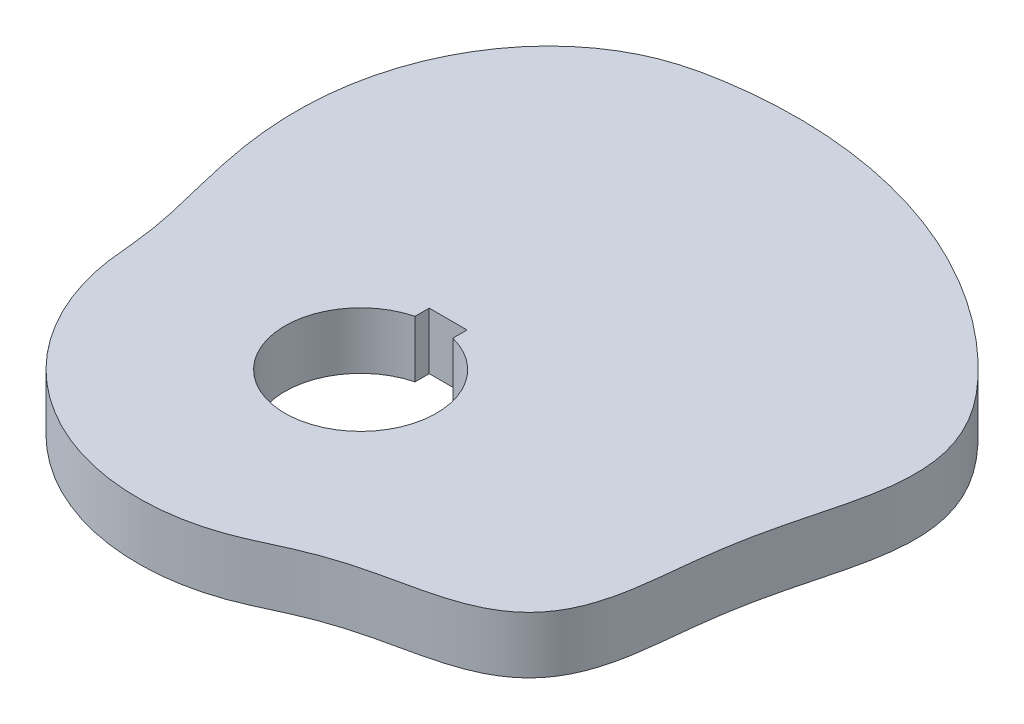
ISO-10303-21;
HEADER;
FILE_DESCRIPTION(('STEP AP214'),'2;1');
FILE_NAME('part.step','',(''),(''),'','','');
FILE_SCHEMA(('AUTOMOTIVE_DESIGN { 1 0 10303 214 1 1 1 1 }'));
ENDSEC;
DATA;
#1=APPLICATION_CONTEXT('core data for automotive mechanical design processes');
#2=APPLICATION_PROTOCOL_DEFINITION('international standard','automotive_design',2000,#1);
#3=PRODUCT_CONTEXT('',#1,'mechanical');
#4=PRODUCT('Part','Part','',(#3));
#5=PRODUCT_RELATED_PRODUCT_CATEGORY('part','',(#4));
#6=PRODUCT_DEFINITION_FORMATION('','',#4);
#7=PRODUCT_DEFINITION_CONTEXT('part definition',#1,'design');
#8=PRODUCT_DEFINITION('design','',#6,#7);
#9=PRODUCT_DEFINITION_SHAPE('','',#8);
#10=(LENGTH_UNIT() NAMED_UNIT(*) SI_UNIT(.MILLI.,.METRE.));
#11=(NAMED_UNIT(*) PLANE_ANGLE_UNIT() SI_UNIT($,.RADIAN.));
#12=(NAMED_UNIT(*) SI_UNIT($,.STERADIAN.) SOLID_ANGLE_UNIT());
#13=UNCERTAINTY_MEASURE_WITH_UNIT(LENGTH_MEASURE(1.E-05),#10,'distance_accuracy_value','');
#14=(GEOMETRIC_REPRESENTATION_CONTEXT(3) GLOBAL_UNCERTAINTY_ASSIGNED_CONTEXT((#13)) GLOBAL_UNIT_ASSIGNED_CONTEXT((#10,
#11,#12)) REPRESENTATION_CONTEXT('',''));
#15=CARTESIAN_POINT('',(0.,0.,0.));
#16=DIRECTION('',(0.,0.,1.));
#17=DIRECTION('',(1.,0.,0.));
#18=AXIS2_PLACEMENT_3D('',#15,#16,#17);
#19=CARTESIAN_POINT('',(0.,-19.05,0.));
#20=DIRECTION('',(0.,1.,0.));
#21=DIRECTION('',(0.,0.,1.));
#22=AXIS2_PLACEMENT_3D('',#19,#20,#21);
#23=PLANE('',#22);
#24=DIRECTION('',(-1.,0.,0.));
#25=VECTOR('',#24,1.);
#26=CARTESIAN_POINT('',(6.35000000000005,-19.05,-29.3559442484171));
#27=LINE('',#26,#25);
#28=CARTESIAN_POINT('',(6.35000000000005,-19.05,-29.3559442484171));
#29=VERTEX_POINT('',#28);
#30=CARTESIAN_POINT('',(-6.34999999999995,-19.05,-29.3559442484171));
#31=VERTEX_POINT('',#30);
#32=EDGE_CURVE('E85',#29,#31,#27,.T.);
#33=ORIENTED_EDGE('',*,*,#32,.T.);
#34=DIRECTION('',(0.,0.,1.));
#35=VECTOR('',#34,1.);
#36=CARTESIAN_POINT('',(-6.34999999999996,-19.05,-24.5934442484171));
#37=LINE('',#36,#35);
#38=CARTESIAN_POINT('',(-6.34999999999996,-19.05,-24.5934442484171));
#39=VERTEX_POINT('',#38);
#40=EDGE_CURVE('E88',#31,#39,#37,.T.);
#41=ORIENTED_EDGE('',*,*,#40,.T.);
#42=CARTESIAN_POINT('',(0.,-19.05,0.));
#43=DIRECTION('',(0.,1.,0.));
#44=DIRECTION('',(0.,0.,1.));
#45=AXIS2_PLACEMENT_3D('',#42,#43,#44);
#46=CIRCLE('',#45,25.4);
#47=CARTESIAN_POINT('',(6.35000000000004,-19.05,-24.5934442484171));
#48=VERTEX_POINT('',#47);
#49=EDGE_CURVE('E11',#39,#48,#46,.T.);
#50=ORIENTED_EDGE('',*,*,#49,.T.);
#51=DIRECTION('',(0.,0.,-1.));
#52=VECTOR('',#51,1.);
#53=CARTESIAN_POINT('',(6.35000000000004,-19.05,-24.5934442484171));
#54=LINE('',#53,#52);
#55=EDGE_CURVE('E46',#48,#29,#54,.T.);
#56=ORIENTED_EDGE('',*,*,#55,.T.);
#57=EDGE_LOOP('',(#33,#41,#50,#56));
#58=FACE_BOUND('',#57,.T.);
#59=CARTESIAN_POINT('',(109.55969871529,-19.05,17.1388118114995));
#60=CARTESIAN_POINT('',(109.670945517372,-19.05,16.4276794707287));
#61=CARTESIAN_POINT('',(109.872598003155,-19.05,15.0511085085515));
#62=CARTESIAN_POINT('',(110.143805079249,-19.05,12.9905840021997));
#63=CARTESIAN_POINT('',(110.390757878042,-19.05,10.9448976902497));
#64=CARTESIAN_POINT('',(110.627231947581,-19.05,8.85282623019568));
#65=CARTESIAN_POINT('',(110.858890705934,-19.05,6.71726758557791));
#66=CARTESIAN_POINT('',(111.091589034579,-19.05,4.54123721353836));
#67=CARTESIAN_POINT('',(111.331217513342,-19.05,2.32793505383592));
#68=CARTESIAN_POINT('',(111.583527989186,-19.05,0.080815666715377));
#69=CARTESIAN_POINT('',(111.85394265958,-19.05,-2.19635778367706));
#70=CARTESIAN_POINT('',(112.147354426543,-19.05,-4.49948827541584));
#71=CARTESIAN_POINT('',(112.46792948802,-19.05,-6.82416009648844));
#72=CARTESIAN_POINT('',(112.818926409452,-19.05,-9.16570034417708));
#73=CARTESIAN_POINT('',(113.202547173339,-19.05,-11.5192854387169));
#74=CARTESIAN_POINT('',(113.619834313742,-19.05,-13.8800831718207));
#75=CARTESIAN_POINT('',(114.070623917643,-19.05,-16.2434137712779));
#76=CARTESIAN_POINT('',(114.553557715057,-19.05,-18.604909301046));
#77=CARTESIAN_POINT('',(115.066150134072,-19.05,-20.9606505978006));
#78=CARTESIAN_POINT('',(115.604899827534,-19.05,-23.3072649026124));
#79=CARTESIAN_POINT('',(116.165431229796,-19.05,-25.6419742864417));
#80=CARTESIAN_POINT('',(116.742650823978,-19.05,-27.9625930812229));
#81=CARTESIAN_POINT('',(117.330904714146,-19.05,-30.2674799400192));
#82=CARTESIAN_POINT('',(117.924127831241,-19.05,-32.5554554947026));
#83=CARTESIAN_POINT('',(118.515979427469,-19.05,-34.825699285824));
#84=CARTESIAN_POINT('',(119.099963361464,-19.05,-37.0776398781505));
#85=CARTESIAN_POINT('',(119.669534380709,-19.05,-39.3108504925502));
#86=CARTESIAN_POINT('',(120.218192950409,-19.05,-41.5249598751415));
#87=CARTESIAN_POINT('',(120.739571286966,-19.05,-43.7195851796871));
#88=CARTESIAN_POINT('',(121.227512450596,-19.05,-45.8942908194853));
#89=CARTESIAN_POINT('',(121.676143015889,-19.05,-48.0485747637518));
#90=CARTESIAN_POINT('',(122.079938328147,-19.05,-50.1818816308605));
#91=CARTESIAN_POINT('',(122.433777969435,-19.05,-52.2936400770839));
#92=CARTESIAN_POINT('',(122.732988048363,-19.05,-54.3833202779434));
#93=CARTESIAN_POINT('',(122.973366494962,-19.05,-56.450505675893));
#94=CARTESIAN_POINT('',(123.151187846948,-19.05,-58.4949716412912));
#95=CARTESIAN_POINT('',(123.263185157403,-19.05,-60.5167624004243));
#96=CARTESIAN_POINT('',(123.306508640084,-19.05,-62.5162567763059));
#97=CARTESIAN_POINT('',(123.278663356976,-19.05,-64.4942132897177));
#98=CARTESIAN_POINT('',(123.177431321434,-19.05,-66.4517862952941));
#99=CARTESIAN_POINT('',(123.000786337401,-19.05,-68.3905072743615));
#100=CARTESIAN_POINT('',(122.746812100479,-19.05,-70.3122291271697));
#101=CARTESIAN_POINT('',(122.413634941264,-19.05,-72.2190359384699));
#102=CARTESIAN_POINT('',(121.999381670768,-19.05,-74.1131255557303));
#103=CARTESIAN_POINT('',(121.502170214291,-19.05,-75.9966765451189));
#104=CARTESIAN_POINT('',(120.92013644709,-19.05,-77.8717138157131));
#105=CARTESIAN_POINT('',(120.25149561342,-19.05,-79.7399878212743));
#106=CARTESIAN_POINT('',(119.49463187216,-19.05,-81.6028805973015));
#107=CARTESIAN_POINT('',(118.648205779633,-19.05,-83.4613483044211));
#108=CARTESIAN_POINT('',(117.71126752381,-19.05,-85.3159051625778));
#109=CARTESIAN_POINT('',(116.683363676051,-19.05,-87.1666486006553));
#110=CARTESIAN_POINT('',(115.564626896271,-19.05,-89.0133209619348));
#111=CARTESIAN_POINT('',(114.355840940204,-19.05,-90.8553998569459));
#112=CARTESIAN_POINT('',(113.058476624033,-19.05,-92.692207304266));
#113=CARTESIAN_POINT('',(111.674698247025,-19.05,-94.5230278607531));
#114=CARTESIAN_POINT('',(110.207341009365,-19.05,-96.3472247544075));
#115=CARTESIAN_POINT('',(108.659869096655,-19.05,-98.1643516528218));
#116=CARTESIAN_POINT('',(107.036298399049,-19.05,-99.9742317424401));
#117=CARTESIAN_POINT('',(105.341172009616,-19.05,-101.777083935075));
#118=CARTESIAN_POINT('',(103.580410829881,-19.05,-103.572216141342));
#119=CARTESIAN_POINT('',(101.7675488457,-19.05,-105.353594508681));
#120=CARTESIAN_POINT('',(99.9146683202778,-19.05,-107.112608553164));
#121=CARTESIAN_POINT('',(98.0300566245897,-19.05,-108.840023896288));
#122=CARTESIAN_POINT('',(96.1156115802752,-19.05,-110.534313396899));
#123=CARTESIAN_POINT('',(94.1718814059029,-19.05,-112.194925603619));
#124=CARTESIAN_POINT('',(92.1994675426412,-19.05,-113.821364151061));
#125=CARTESIAN_POINT('',(90.1989682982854,-19.05,-115.413131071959));
#126=CARTESIAN_POINT('',(88.1709937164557,-19.05,-116.969742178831));
#127=CARTESIAN_POINT('',(86.116161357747,-19.05,-118.490723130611));
#128=CARTESIAN_POINT('',(84.0350971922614,-19.05,-119.9756106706));
#129=CARTESIAN_POINT('',(81.9284351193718,-19.05,-121.423952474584));
#130=CARTESIAN_POINT('',(79.7968168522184,-19.05,-122.835307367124));
#131=CARTESIAN_POINT('',(77.6408917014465,-19.05,-124.20924543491));
#132=CARTESIAN_POINT('',(75.4613163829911,-19.05,-125.545348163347));
#133=CARTESIAN_POINT('',(73.258754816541,-19.05,-126.843208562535));
#134=CARTESIAN_POINT('',(71.0338779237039,-19.05,-128.10243129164));
#135=CARTESIAN_POINT('',(68.7873634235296,-19.05,-129.322632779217));
#136=CARTESIAN_POINT('',(66.5198956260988,-19.05,-130.503441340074));
#137=CARTESIAN_POINT('',(64.2321652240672,-19.05,-131.644497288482));
#138=CARTESIAN_POINT('',(61.9248690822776,-19.05,-132.745453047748));
#139=CARTESIAN_POINT('',(59.5987100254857,-19.05,-133.805973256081));
#140=CARTESIAN_POINT('',(57.2543966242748,-19.05,-134.825734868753));
#141=CARTESIAN_POINT('',(54.8926429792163,-19.05,-135.804427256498));
#142=CARTESIAN_POINT('',(52.5141685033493,-19.05,-136.741752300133));
#143=CARTESIAN_POINT('',(50.1196977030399,-19.05,-137.637424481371));
#144=CARTESIAN_POINT('',(47.7099599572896,-19.05,-138.491170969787));
#145=CARTESIAN_POINT('',(45.2856892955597,-19.05,-139.302731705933));
#146=CARTESIAN_POINT('',(42.8476241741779,-19.05,-140.071859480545));
#147=CARTESIAN_POINT('',(40.3965072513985,-19.05,-140.798320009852));
#148=CARTESIAN_POINT('',(37.9330851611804,-19.05,-141.481892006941));
#149=CARTESIAN_POINT('',(35.4581082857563,-19.05,-142.122367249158));
#150=CARTESIAN_POINT('',(32.972330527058,-19.05,-142.719550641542));
#151=CARTESIAN_POINT('',(30.476509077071,-19.05,-143.273260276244));
#152=CARTESIAN_POINT('',(27.9714041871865,-19.05,-143.783327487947));
#153=CARTESIAN_POINT('',(25.4577789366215,-19.05,-144.249596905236));
#154=CARTESIAN_POINT('',(22.9363989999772,-19.05,-144.671926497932));
#155=CARTESIAN_POINT('',(20.4080324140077,-19.05,-145.050187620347));
#156=CARTESIAN_POINT('',(17.8734493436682,-19.05,-145.384265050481));
#157=CARTESIAN_POINT('',(15.3334218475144,-19.05,-145.674057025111));
#158=CARTESIAN_POINT('',(12.7887236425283,-19.05,-145.919475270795));
#159=CARTESIAN_POINT('',(10.240129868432,-19.05,-146.120445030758));
#160=CARTESIAN_POINT('',(7.68841685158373,-19.05,-146.276905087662));
#161=CARTESIAN_POINT('',(5.13436186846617,-19.05,-146.388807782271));
#162=CARTESIAN_POINT('',(2.57874290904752,-19.05,-146.456119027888));
#163=CARTESIAN_POINT('',(0.0223384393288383,-19.05,-146.478818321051));
#164=CARTESIAN_POINT('',(-2.53407283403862,-19.05,-146.456898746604));
#165=CARTESIAN_POINT('',(-5.0897122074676,-19.05,-146.390366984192));
#166=CARTESIAN_POINT('',(-7.64380119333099,-19.05,-146.279243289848));
#167=CARTESIAN_POINT('',(-10.1955618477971,-19.05,-146.123561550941));
#168=CARTESIAN_POINT('',(-12.7442166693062,-19.05,-145.923369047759));
#169=CARTESIAN_POINT('',(-15.2889900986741,-19.05,-145.678727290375));
#170=CARTESIAN_POINT('',(-17.8291040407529,-19.05,-145.389708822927));
#171=CARTESIAN_POINT('',(-20.2793078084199,-19.05,-145.067518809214));
#172=CARTESIAN_POINT('',(-22.7975583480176,-19.05,-144.693783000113));
#173=CARTESIAN_POINT('',(-25.2822324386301,-19.05,-144.280971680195));
#174=CARTESIAN_POINT('',(-27.7995697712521,-19.05,-143.804871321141));
#175=CARTESIAN_POINT('',(-30.1782806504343,-19.05,-143.294295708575));
#176=CARTESIAN_POINT('',(-32.5058507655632,-19.05,-142.726979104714));
#177=CARTESIAN_POINT('',(-34.7867962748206,-19.05,-142.096811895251));
#178=CARTESIAN_POINT('',(-37.0260919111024,-19.05,-141.397982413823));
#179=CARTESIAN_POINT('',(-39.2289072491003,-19.05,-140.625031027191));
#180=CARTESIAN_POINT('',(-41.4002085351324,-19.05,-139.772696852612));
#181=CARTESIAN_POINT('',(-43.5449013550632,-19.05,-138.836685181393));
#182=CARTESIAN_POINT('',(-45.6655244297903,-19.05,-137.811466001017));
#183=CARTESIAN_POINT('',(-47.7644316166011,-19.05,-136.69754639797));
#184=CARTESIAN_POINT('',(-49.8392728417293,-19.05,-135.492553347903));
#185=CARTESIAN_POINT('',(-51.8870570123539,-19.05,-134.197134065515));
#186=CARTESIAN_POINT('',(-53.9041278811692,-19.05,-132.811816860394));
#187=CARTESIAN_POINT('',(-55.8868308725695,-19.05,-131.337583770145));
#188=CARTESIAN_POINT('',(-57.8314470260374,-19.05,-129.775684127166));
#189=CARTESIAN_POINT('',(-59.734248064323,-19.05,-128.127693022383));
#190=CARTESIAN_POINT('',(-61.5915198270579,-19.05,-126.395499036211));
#191=CARTESIAN_POINT('',(-63.3995950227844,-19.05,-124.581307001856));
#192=CARTESIAN_POINT('',(-65.1548836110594,-19.05,-122.687632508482));
#193=CARTESIAN_POINT('',(-66.8539034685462,-19.05,-120.717294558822));
#194=CARTESIAN_POINT('',(-68.4933101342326,-19.05,-118.673404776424));
#195=CARTESIAN_POINT('',(-70.0699255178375,-19.05,-116.559353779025));
#196=CARTESIAN_POINT('',(-71.5807652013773,-19.05,-114.378794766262));
#197=CARTESIAN_POINT('',(-73.0230640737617,-19.05,-112.135624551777));
#198=CARTESIAN_POINT('',(-74.3943000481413,-19.05,-109.833962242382));
#199=CARTESIAN_POINT('',(-75.6922156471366,-19.05,-107.478125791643));
#200=CARTESIAN_POINT('',(-76.9148372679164,-19.05,-105.072606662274));
#201=CARTESIAN_POINT('',(-78.0604919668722,-19.05,-102.622042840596));
#202=CARTESIAN_POINT('',(-79.1278216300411,-19.05,-100.131190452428));
#203=CARTESIAN_POINT('',(-80.115794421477,-19.05,-97.6048942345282));
#204=CARTESIAN_POINT('',(-81.0237134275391,-19.05,-95.0480571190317));
#205=CARTESIAN_POINT('',(-81.851222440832,-19.05,-92.4656091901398));
#206=CARTESIAN_POINT('',(-82.5983088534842,-19.05,-89.8624762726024));
#207=CARTESIAN_POINT('',(-83.2653036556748,-19.05,-87.2435484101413));
#208=CARTESIAN_POINT('',(-83.8528785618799,-19.05,-84.6136484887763));
#209=CARTESIAN_POINT('',(-84.3620403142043,-19.05,-81.977501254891));
#210=CARTESIAN_POINT('',(-84.7941222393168,-19.05,-79.339702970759));
#211=CARTESIAN_POINT('',(-85.1507731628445,-19.05,-76.7046919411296));
#212=CARTESIAN_POINT('',(-85.4339438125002,-19.05,-74.0767201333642));
#213=CARTESIAN_POINT('',(-85.6458708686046,-19.05,-71.4598261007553));
#214=CARTESIAN_POINT('',(-85.7890588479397,-19.05,-68.8578094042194));
#215=CARTESIAN_POINT('',(-85.8662600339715,-19.05,-66.2742067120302));
#216=CARTESIAN_POINT('',(-85.8804526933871,-19.05,-63.7122697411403));
#217=CARTESIAN_POINT('',(-85.8348178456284,-19.05,-61.1749451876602));
#218=CARTESIAN_POINT('',(-85.7327148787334,-19.05,-58.6648567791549));
#219=CARTESIAN_POINT('',(-85.5776563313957,-19.05,-56.1842895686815));
#220=CARTESIAN_POINT('',(-85.3732821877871,-19.05,-53.7351765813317));
#221=CARTESIAN_POINT('',(-85.12333405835,-19.05,-51.319087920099));
#222=CARTESIAN_POINT('',(-84.8316296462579,-19.05,-48.9372224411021));
#223=CARTESIAN_POINT('',(-84.5020379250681,-19.05,-46.5904021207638));
#224=CARTESIAN_POINT('',(-84.1384554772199,-19.05,-44.279069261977));
#225=CARTESIAN_POINT('',(-83.7447844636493,-19.05,-42.003286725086));
#226=CARTESIAN_POINT('',(-83.3249127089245,-19.05,-39.7627414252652));
#227=CARTESIAN_POINT('',(-82.8826963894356,-19.05,-37.5567514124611));
#228=CARTESIAN_POINT('',(-82.4219457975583,-19.05,-35.3842769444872));
#229=CARTESIAN_POINT('',(-81.9464146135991,-19.05,-33.2439360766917));
#230=CARTESIAN_POINT('',(-81.4597930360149,-19.05,-31.1340254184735));
#231=CARTESIAN_POINT('',(-80.9657049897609,-19.05,-29.0525468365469));
#232=CARTESIAN_POINT('',(-80.467709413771,-19.05,-26.9972410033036));
#233=CARTESIAN_POINT('',(-79.9693053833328,-19.05,-24.965628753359));
#234=CARTESIAN_POINT('',(-79.4739402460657,-19.05,-22.9550612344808));
#235=CARTESIAN_POINT('',(-78.9850201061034,-19.05,-20.9627795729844));
#236=CARTESIAN_POINT('',(-78.5059189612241,-19.05,-18.9859848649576));
#237=CARTESIAN_POINT('',(-78.0399910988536,-19.05,-17.0219170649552));
#238=CARTESIAN_POINT('',(-77.5905577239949,-19.05,-15.0679463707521));
#239=CARTESIAN_POINT('',(-77.1609602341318,-19.05,-13.1216573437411));
#240=CARTESIAN_POINT('',(-76.7543217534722,-19.05,-11.1809859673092));
#241=CARTESIAN_POINT('',(-76.3743221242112,-19.05,-9.2441410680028));
#242=CARTESIAN_POINT('',(-76.0225094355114,-19.05,-7.31232152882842));
#243=CARTESIAN_POINT('',(-75.7055371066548,-19.05,-5.3905466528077));
#244=CARTESIAN_POINT('',(-75.4239506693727,-19.05,-3.49001674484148));
#245=CARTESIAN_POINT('',(-75.1783443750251,-19.05,-1.6245948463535));
#246=CARTESIAN_POINT('',(-74.9660618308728,-19.05,0.191206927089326));
#247=CARTESIAN_POINT('',(-74.7822104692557,-19.05,1.94347786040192));
#248=CARTESIAN_POINT('',(-74.6200232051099,-19.05,3.61972320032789));
#249=CARTESIAN_POINT('',(-74.4717326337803,-19.05,5.20953815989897));
#250=CARTESIAN_POINT('',(-74.3292276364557,-19.05,6.70500884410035));
#251=CARTESIAN_POINT('',(-74.1849475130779,-19.05,8.10509308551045));
#252=CARTESIAN_POINT('',(-74.0277742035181,-19.05,9.43626953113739));
#253=CARTESIAN_POINT('',(-73.8510093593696,-19.05,10.7308599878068));
#254=CARTESIAN_POINT('',(-73.6525286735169,-19.05,12.0181093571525));
#255=CARTESIAN_POINT('',(-73.4315536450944,-19.05,13.3016912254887));
#256=CARTESIAN_POINT('',(-73.1882264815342,-19.05,14.5812230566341));
#257=CARTESIAN_POINT('',(-72.922601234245,-19.05,15.85631282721));
#258=CARTESIAN_POINT('',(-72.6347641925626,-19.05,17.1265727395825));
#259=CARTESIAN_POINT('',(-72.3248015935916,-19.05,18.3916156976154));
#260=CARTESIAN_POINT('',(-71.9928082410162,-19.05,19.6510564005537));
#261=CARTESIAN_POINT('',(-71.6388851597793,-19.05,20.9045111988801));
#262=CARTESIAN_POINT('',(-71.2631401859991,-19.05,22.1515982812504));
#263=CARTESIAN_POINT('',(-70.865687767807,-19.05,23.3919377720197));
#264=CARTESIAN_POINT('',(-70.44664897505,-19.05,24.6251518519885));
#265=CARTESIAN_POINT('',(-70.0061514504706,-19.05,25.850864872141));
#266=CARTESIAN_POINT('',(-69.5443293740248,-19.05,27.0687034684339));
#267=CARTESIAN_POINT('',(-69.0613234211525,-19.05,28.278296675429));
#268=CARTESIAN_POINT('',(-68.5572807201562,-19.05,29.4792760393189));
#269=CARTESIAN_POINT('',(-68.0323548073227,-19.05,30.6712757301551));
#270=CARTESIAN_POINT('',(-67.4867055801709,-19.05,31.8539326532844));
#271=CARTESIAN_POINT('',(-66.9204992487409,-19.05,33.0268865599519));
#272=CARTESIAN_POINT('',(-66.333908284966,-19.05,34.1897801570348));
#273=CARTESIAN_POINT('',(-65.7271113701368,-19.05,35.3422592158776));
#274=CARTESIAN_POINT('',(-65.1002933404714,-19.05,36.4839726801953));
#275=CARTESIAN_POINT('',(-64.4536451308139,-19.05,37.6145727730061));
#276=CARTESIAN_POINT('',(-63.7873637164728,-19.05,38.7337151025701));
#277=CARTESIAN_POINT('',(-63.1016520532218,-19.05,39.8410587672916));
#278=CARTESIAN_POINT('',(-62.396719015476,-19.05,40.9362664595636));
#279=CARTESIAN_POINT('',(-61.6727793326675,-19.05,42.0190045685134));
#280=CARTESIAN_POINT('',(-60.9300535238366,-19.05,43.0889432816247));
#281=CARTESIAN_POINT('',(-60.1687678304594,-19.05,44.1457566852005));
#282=CARTESIAN_POINT('',(-59.3891541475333,-19.05,45.1891228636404));
#283=CARTESIAN_POINT('',(-58.5914499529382,-19.05,46.2187239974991));
#284=CARTESIAN_POINT('',(-57.7758982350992,-19.05,47.2342464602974));
#285=CARTESIAN_POINT('',(-56.9427474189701,-19.05,48.2353809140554));
#286=CARTESIAN_POINT('',(-56.0922512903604,-19.05,49.2218224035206));
#287=CARTESIAN_POINT('',(-55.22466891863,-19.05,50.1932704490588));
#288=CARTESIAN_POINT('',(-54.3402645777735,-19.05,51.1494291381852));
#289=CARTESIAN_POINT('',(-53.4393076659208,-19.05,52.0900072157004));
#290=CARTESIAN_POINT('',(-52.5220726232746,-19.05,53.0147181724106));
#291=CARTESIAN_POINT('',(-51.5888388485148,-19.05,53.9232803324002));
#292=CARTESIAN_POINT('',(-50.6398906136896,-19.05,54.8154169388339));
#293=CARTESIAN_POINT('',(-49.6755169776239,-19.05,55.6908562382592));
#294=CARTESIAN_POINT('',(-48.696011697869,-19.05,56.5493315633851));
#295=CARTESIAN_POINT('',(-47.701673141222,-19.05,57.3905814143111));
#296=CARTESIAN_POINT('',(-46.6928041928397,-19.05,58.2143495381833));
#297=CARTESIAN_POINT('',(-45.6697121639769,-19.05,59.0203850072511));
#298=CARTESIAN_POINT('',(-44.6327086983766,-19.05,59.8084422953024));
#299=CARTESIAN_POINT('',(-43.5821096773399,-19.05,60.5782813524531));
#300=CARTESIAN_POINT('',(-42.5182351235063,-19.05,61.3296676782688));
#301=CARTESIAN_POINT('',(-41.4414091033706,-19.05,62.062372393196));
#302=CARTESIAN_POINT('',(-40.3519596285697,-19.05,62.7761723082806));
#303=CARTESIAN_POINT('',(-39.2502185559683,-19.05,63.4708499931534));
#304=CARTESIAN_POINT('',(-38.1365214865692,-19.05,64.1461938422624));
#305=CARTESIAN_POINT('',(-37.0112076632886,-19.05,64.8019981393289));
#306=CARTESIAN_POINT('',(-35.8746198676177,-19.05,65.4380631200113));
#307=CARTESIAN_POINT('',(-34.7271043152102,-19.05,66.0541950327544));
#308=CARTESIAN_POINT('',(-33.5690105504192,-19.05,66.6502061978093));
#309=CARTESIAN_POINT('',(-32.4006913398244,-19.05,67.2259150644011));
#310=CARTESIAN_POINT('',(-31.2225025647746,-19.05,67.7811462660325));
#311=CARTESIAN_POINT('',(-30.0348031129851,-19.05,68.3157306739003));
#312=CARTESIAN_POINT('',(-28.8379547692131,-19.05,68.8295054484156));
#313=CARTESIAN_POINT('',(-27.6323221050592,-19.05,69.3223140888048));
#314=CARTESIAN_POINT('',(-26.4182723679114,-19.05,69.7940064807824));
#315=CARTESIAN_POINT('',(-25.1961753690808,-19.05,70.2444389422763));
#316=CARTESIAN_POINT('',(-23.9664033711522,-19.05,70.6734742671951));
#317=CARTESIAN_POINT('',(-22.7293309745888,-19.05,71.0809817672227));
#318=CARTESIAN_POINT('',(-21.485335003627,-19.05,71.4668373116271));
#319=CARTESIAN_POINT('',(-20.2347943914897,-19.05,71.8309233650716));
#320=CARTESIAN_POINT('',(-18.9780900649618,-19.05,72.1731290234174));
#321=CARTESIAN_POINT('',(-17.7156048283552,-19.05,72.4933500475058));
#322=CARTESIAN_POINT('',(-16.4477232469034,-19.05,72.7914888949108));
#323=CARTESIAN_POINT('',(-15.1748315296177,-19.05,73.0674547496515));
#324=CARTESIAN_POINT('',(-13.8973174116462,-19.05,73.3211635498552));
#325=CARTESIAN_POINT('',(-12.6155700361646,-19.05,73.5525380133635));
#326=CARTESIAN_POINT('',(-11.3299798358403,-19.05,73.7615076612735));
#327=CARTESIAN_POINT('',(-10.0409384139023,-19.05,73.948008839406));
#328=CARTESIAN_POINT('',(-8.74883842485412,-19.05,74.1119847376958));
#329=CARTESIAN_POINT('',(-7.45407345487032,-19.05,74.2533854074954));
#330=CARTESIAN_POINT('',(-6.15703790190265,-19.05,74.3721677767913));
#331=CARTESIAN_POINT('',(-4.85812685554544,-19.05,74.4682956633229));
#332=CARTESIAN_POINT('',(-3.55773597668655,-19.05,74.541739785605));
#333=CARTESIAN_POINT('',(-2.25626137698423,-19.05,74.5924777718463));
#334=CARTESIAN_POINT('',(-0.954099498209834,-19.05,74.6204941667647));
#335=CARTESIAN_POINT('',(0.348353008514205,-19.05,74.625780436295));
#336=CARTESIAN_POINT('',(1.65069940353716,-19.05,74.6083349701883));
#337=CARTESIAN_POINT('',(2.9525429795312,-19.05,74.5681630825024));
#338=CARTESIAN_POINT('',(4.25348718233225,-19.05,74.5052770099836));
#339=CARTESIAN_POINT('',(5.55313573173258,-19.05,74.4196959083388));
#340=CARTESIAN_POINT('',(6.8510927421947,-19.05,74.3114458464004));
#341=CARTESIAN_POINT('',(8.14696284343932,-19.05,74.1805597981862));
#342=CARTESIAN_POINT('',(9.44035130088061,-19.05,74.0270776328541));
#343=CARTESIAN_POINT('',(10.7308641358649,-19.05,73.8510461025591));
#344=CARTESIAN_POINT('',(12.0181082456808,-19.05,73.6525188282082));
#345=CARTESIAN_POINT('',(13.3016915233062,-19.05,73.4315562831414));
#346=CARTESIAN_POINT('',(14.5812229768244,-19.05,73.1882257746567));
#347=CARTESIAN_POINT('',(15.8563128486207,-19.05,72.92260142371));
#348=CARTESIAN_POINT('',(17.1265727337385,-19.05,72.6347641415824));
#349=CARTESIAN_POINT('',(18.3916156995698,-19.05,72.3248016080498));
#350=CARTESIAN_POINT('',(19.6510563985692,-19.05,71.9928082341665));
#351=CARTESIAN_POINT('',(20.9045112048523,-19.05,71.6388851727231));
#352=CARTESIAN_POINT('',(22.1515982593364,-19.05,71.2631401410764));
#353=CARTESIAN_POINT('',(23.3919378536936,-19.05,70.865687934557));
#354=CARTESIAN_POINT('',(24.6251515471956,-19.05,70.4466483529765));
#355=CARTESIAN_POINT('',(25.8508660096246,-19.05,70.0061537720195));
#356=CARTESIAN_POINT('',(27.0686992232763,-19.05,69.5443207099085));
#357=CARTESIAN_POINT('',(28.2856565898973,-19.05,69.0584234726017));
#358=CARTESIAN_POINT('',(29.518687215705,-19.05,68.5405069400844));
#359=CARTESIAN_POINT('',(30.7862874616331,-19.05,67.9868482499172));
#360=CARTESIAN_POINT('',(32.0994586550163,-19.05,67.3969706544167));
#361=CARTESIAN_POINT('',(33.4586560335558,-19.05,66.7753267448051));
#362=CARTESIAN_POINT('',(34.8642688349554,-19.05,66.1270100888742));
#363=CARTESIAN_POINT('',(36.3165849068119,-19.05,65.4575952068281));
#364=CARTESIAN_POINT('',(37.8156386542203,-19.05,64.7730676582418));
#365=CARTESIAN_POINT('',(39.3610404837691,-19.05,64.0797075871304));
#366=CARTESIAN_POINT('',(40.9518173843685,-19.05,63.3839409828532));
#367=CARTESIAN_POINT('',(42.5862836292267,-19.05,62.6921505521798));
#368=CARTESIAN_POINT('',(44.2619638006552,-19.05,62.0104533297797));
#369=CARTESIAN_POINT('',(45.9755845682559,-19.05,61.3444586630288));
#370=CARTESIAN_POINT('',(47.7231428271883,-19.05,60.6990284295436));
#371=CARTESIAN_POINT('',(49.5000454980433,-19.05,60.0780652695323));
#372=CARTESIAN_POINT('',(51.3013036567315,-19.05,59.4843534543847));
#373=CARTESIAN_POINT('',(53.1217538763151,-19.05,58.9194702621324));
#374=CARTESIAN_POINT('',(54.9562754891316,-19.05,58.3837750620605));
#375=CARTESIAN_POINT('',(56.799974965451,-19.05,57.8764715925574));
#376=CARTESIAN_POINT('',(58.6483167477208,-19.05,57.3957292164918));
#377=CARTESIAN_POINT('',(60.4971910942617,-19.05,56.9388433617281));
#378=CARTESIAN_POINT('',(62.3429207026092,-19.05,56.502414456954));
#379=CARTESIAN_POINT('',(64.1822166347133,-19.05,56.0825275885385));
#380=CARTESIAN_POINT('',(66.0120991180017,-19.05,55.6749201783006));
#381=CARTESIAN_POINT('',(67.8298001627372,-19.05,55.2751305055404));
#382=CARTESIAN_POINT('',(69.6326634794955,-19.05,54.8786246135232));
#383=CARTESIAN_POINT('',(71.4180540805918,-19.05,54.4809024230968));
#384=CARTESIAN_POINT('',(73.1832862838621,-19.05,54.0775856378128));
#385=CARTESIAN_POINT('',(74.9255753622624,-19.05,53.6644905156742));
#386=CARTESIAN_POINT('',(76.642015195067,-19.05,53.2376881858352));
#387=CARTESIAN_POINT('',(78.3295820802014,-19.05,52.7935542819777));
#388=CARTESIAN_POINT('',(79.9851632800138,-19.05,52.328808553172));
#389=CARTESIAN_POINT('',(81.6056077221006,-19.05,51.8405440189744));
#390=CARTESIAN_POINT('',(83.1877953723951,-19.05,51.3262443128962));
#391=CARTESIAN_POINT('',(84.7287209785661,-19.05,50.7837872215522));
#392=CARTESIAN_POINT('',(86.2255870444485,-19.05,50.2114321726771));
#393=CARTESIAN_POINT('',(87.6759000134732,-19.05,49.6077896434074));
#394=CARTESIAN_POINT('',(89.0775627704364,-19.05,48.9717712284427));
#395=CARTESIAN_POINT('',(90.4289558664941,-19.05,48.3025204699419));
#396=CARTESIAN_POINT('',(91.7289995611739,-19.05,47.5993264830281));
#397=CARTESIAN_POINT('',(92.9771891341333,-19.05,46.861524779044));
#398=CARTESIAN_POINT('',(94.1735972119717,-19.05,46.0883922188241));
#399=CARTESIAN_POINT('',(95.3188392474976,-19.05,45.2790453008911));
#400=CARTESIAN_POINT('',(96.4140017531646,-19.05,44.4323524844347));
#401=CARTESIAN_POINT('',(97.4605371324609,-19.05,43.5468714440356));
#402=CARTESIAN_POINT('',(98.4601333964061,-19.05,42.6208206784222));
#403=CARTESIAN_POINT('',(99.414570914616,-19.05,41.6520916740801));
#404=CARTESIAN_POINT('',(100.325580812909,-19.05,40.6383031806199));
#405=CARTESIAN_POINT('',(101.194720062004,-19.05,39.5768938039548));
#406=CARTESIAN_POINT('',(102.023276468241,-19.05,38.4652440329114));
#407=CARTESIAN_POINT('',(102.812212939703,-19.05,37.3008149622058));
#408=CARTESIAN_POINT('',(103.562155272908,-19.05,36.0812890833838));
#409=CARTESIAN_POINT('',(104.273422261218,-19.05,34.804698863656));
#410=CARTESIAN_POINT('',(104.94609213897,-19.05,33.4695312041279));
#411=CARTESIAN_POINT('',(105.580095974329,-19.05,32.0747996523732));
#412=CARTESIAN_POINT('',(106.175326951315,-19.05,30.6200806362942));
#413=CARTESIAN_POINT('',(106.731754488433,-19.05,29.1055142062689));
#414=CARTESIAN_POINT('',(107.249533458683,-19.05,27.5317732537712));
#415=CARTESIAN_POINT('',(107.729100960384,-19.05,25.9000075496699));
#416=CARTESIAN_POINT('',(108.171255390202,-19.05,24.2117703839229));
#417=CARTESIAN_POINT('',(108.577215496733,-19.05,22.4689353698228));
#418=CARTESIAN_POINT('',(108.94865677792,-19.05,20.6736126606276));
#419=CARTESIAN_POINT('',(109.276057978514,-19.05,18.8916093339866));
#420=CARTESIAN_POINT('',(109.470827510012,-19.05,17.7069107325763));
#421=CARTESIAN_POINT('',(109.55969871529,-19.05,17.1388118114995));
#422=B_SPLINE_CURVE_WITH_KNOTS('',3,(#59,#60,#61,#62,#63,#64,#65,#66,#67,#68,#69,#70,#71,#72,
#73,#74,#75,#76,#77,#78,#79,#80,#81,#82,#83,#84,#85,#86,#87,#88,#89,#90,#91,#92,#93,#94,#95,#96,
#97,#98,#99,#100,#101,#102,#103,#104,#105,#106,#107,#108,#109,#110,#111,#112,#113,#114,#115,
#116,#117,#118,#119,#120,#121,#122,#123,#124,#125,#126,#127,#128,#129,#130,#131,#132,#133,#134,
#135,#136,#137,#138,#139,#140,#141,#142,#143,#144,#145,#146,#147,#148,#149,#150,#151,#152,#153,
#154,#155,#156,#157,#158,#159,#160,#161,#162,#163,#164,#165,#166,#167,#168,#169,#170,#171,#172,
#173,#174,#175,#176,#177,#178,#179,#180,#181,#182,#183,#184,#185,#186,#187,#188,#189,#190,#191,
#192,#193,#194,#195,#196,#197,#198,#199,#200,#201,#202,#203,#204,#205,#206,#207,#208,#209,#210,
#211,#212,#213,#214,#215,#216,#217,#218,#219,#220,#221,#222,#223,#224,#225,#226,#227,#228,#229,
#230,#231,#232,#233,#234,#235,#236,#237,#238,#239,#240,#241,#242,#243,#244,#245,#246,#247,#248,
#249,#250,#251,#252,#253,#254,#255,#256,#257,#258,#259,#260,#261,#262,#263,#264,#265,#266,#267,
#268,#269,#270,#271,#272,#273,#274,#275,#276,#277,#278,#279,#280,#281,#282,#283,#284,#285,#286,
#287,#288,#289,#290,#291,#292,#293,#294,#295,#296,#297,#298,#299,#300,#301,#302,#303,#304,#305,
#306,#307,#308,#309,#310,#311,#312,#313,#314,#315,#316,#317,#318,#319,#320,#321,#322,#323,#324,
#325,#326,#327,#328,#329,#330,#331,#332,#333,#334,#335,#336,#337,#338,#339,#340,#341,#342,#343,
#344,#345,#346,#347,#348,#349,#350,#351,#352,#353,#354,#355,#356,#357,#358,#359,#360,#361,#362,
#363,#364,#365,#366,#367,#368,#369,#370,#371,#372,#373,#374,#375,#376,#377,#378,#379,#380,#381,
#382,#383,#384,#385,#386,#387,#388,#389,#390,#391,#392,#393,#394,#395,#396,#397,#398,#399,#400,
#401,#402,#403,#404,#405,#406,#407,#408,#409,#410,#411,#412,#413,#414,#415,#416,#417,#418,#419,
#420,#421),.UNSPECIFIED.,.T.,.F.,(4,1,1,1,1,1,1,1,1,1,1,1,1,1,1,1,1,1,1,1,1,1,1,1,1,1,1,1,1,1,1,
1,1,1,1,1,1,1,1,1,1,1,1,1,1,1,1,1,1,1,1,1,1,1,1,1,1,1,1,1,1,1,1,1,1,1,1,1,1,1,1,1,1,1,1,1,1,1,1,
1,1,1,1,1,1,1,1,1,1,1,1,1,1,1,1,1,1,1,1,1,1,1,1,1,1,1,1,1,1,1,1,1,1,1,1,1,1,1,1,1,1,1,1,1,1,1,1,
1,1,1,1,1,1,1,1,1,1,1,1,1,1,1,1,1,1,1,1,1,1,1,1,1,1,1,1,1,1,1,1,1,1,1,1,1,1,1,1,1,1,1,1,1,1,1,1,
1,1,1,1,1,1,1,1,1,1,1,1,1,1,1,1,1,1,1,1,1,1,1,1,1,1,1,1,1,1,1,1,1,1,1,1,1,1,1,1,1,1,1,1,1,1,1,1,
1,1,1,1,1,1,1,1,1,1,1,1,1,1,1,1,1,1,1,1,1,1,1,1,1,1,1,1,1,1,1,1,1,1,1,1,1,1,1,1,1,1,1,1,1,1,1,1,
1,1,1,1,1,1,1,1,1,1,1,1,1,1,1,1,1,1,1,1,1,1,1,1,1,1,1,1,1,1,1,1,1,1,1,1,1,1,1,1,1,1,1,1,1,1,1,1,
1,1,1,1,1,1,1,1,1,1,1,1,1,1,1,1,1,1,1,1,1,1,1,1,1,1,1,1,1,1,1,1,1,1,1,1,1,1,1,1,1,4),(0.,
0.00311396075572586,0.00601870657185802,0.00899113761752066,0.012028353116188,
0.0151272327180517,0.0182844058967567,0.0214962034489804,0.0247586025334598,0.0280671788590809,
0.0314170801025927,0.034803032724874,0.0382193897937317,0.0416602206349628,0.0451194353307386,
0.0485909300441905,0.05206873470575,0.0555471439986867,0.0590208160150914,0.0624848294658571,
0.0659346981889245,0.0693663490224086,0.0727760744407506,0.0761604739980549,0.0795163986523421,
0.0828409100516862,0.0861312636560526,0.0893849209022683,0.0925995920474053,0.0957733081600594,
0.0989045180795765,0.101992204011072,0.105036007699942,0.10803635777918,0.110994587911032,
0.113913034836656,0.116795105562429,0.119645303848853,0.122469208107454,0.125273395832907,
0.128065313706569,0.130853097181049,0.133645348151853,0.136450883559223,0.13927847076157,
0.142136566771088,0.145033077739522,0.147975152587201,0.150969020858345,0.154019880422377,
0.157131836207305,0.160307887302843,0.163549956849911,0.166858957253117,0.170234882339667,
0.17367691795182,0.177183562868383,0.180752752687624,0.184381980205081,0.188061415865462,
0.191747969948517,0.195434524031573,0.199121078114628,0.202807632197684,0.20649418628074,
0.210180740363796,0.213867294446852,0.217553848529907,0.221240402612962,0.224926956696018,
0.228613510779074,0.23230006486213,0.235986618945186,0.239673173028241,0.243359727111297,
0.247046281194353,0.250732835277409,0.254419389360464,0.258105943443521,0.261792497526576,
0.265479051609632,0.269165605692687,0.272852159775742,0.276538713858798,0.280225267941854,
0.28391182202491,0.287598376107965,0.291284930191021,0.294971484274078,0.298658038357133,
0.302344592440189,0.306031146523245,0.3097177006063,0.313404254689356,0.317090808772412,
0.320777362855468,0.324463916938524,0.328150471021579,0.331837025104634,0.33552357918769,
0.339210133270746,0.342896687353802,0.346583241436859,0.350269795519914,0.353956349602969,
0.357642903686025,0.361329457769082,0.365016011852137,0.368702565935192,0.372389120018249,
0.376075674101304,0.37976222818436,0.383080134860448,0.387089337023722,0.390658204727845,
0.3941630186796,0.397613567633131,0.401021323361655,0.404399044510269,0.40776029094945,
0.411118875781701,0.414488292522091,0.417881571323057,0.421306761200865,0.424765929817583,
0.428259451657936,0.43178744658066,0.435349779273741,0.438946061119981,0.442575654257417,
0.446237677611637,0.449931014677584,0.45365432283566,0.457406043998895,0.461184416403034,
0.464987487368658,0.468813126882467,0.472659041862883,0.476522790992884,0.480401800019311,
0.484293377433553,0.488194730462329,0.492102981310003,0.496015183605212,0.499928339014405,
0.50383941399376,0.507745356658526,0.511643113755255,0.515529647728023,0.519401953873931,
0.523257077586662,0.52709213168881,0.530904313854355,0.534690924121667,0.538449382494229,
0.542177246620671,0.545872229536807,0.549532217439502,0.553155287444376,0.556739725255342,
0.560284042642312,0.56378699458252,0.567247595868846,0.570665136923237,0.574039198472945,
0.577369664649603,0.580656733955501,0.583900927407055,0.587103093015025,0.590264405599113,
0.593386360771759,0.596470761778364,0.599519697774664,0.602535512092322,0.60552075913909,
0.608478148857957,0.611410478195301,0.614320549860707,0.617211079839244,0.620084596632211,
0.62294333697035,0.625789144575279,0.628623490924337,0.631438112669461,0.634215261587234,
0.636935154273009,0.639577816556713,0.642124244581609,0.644557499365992,0.646863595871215,
0.649032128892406,0.651056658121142,0.652952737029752,0.654830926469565,0.656709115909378,
0.65858730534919,0.660465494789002,0.662343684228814,0.664221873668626,0.666100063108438,
0.667978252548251,0.669856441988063,0.671734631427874,0.673612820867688,0.675491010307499,
0.677369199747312,0.679247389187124,0.681125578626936,0.683003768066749,0.684881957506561,
0.686760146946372,0.688638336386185,0.690516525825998,0.692394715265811,0.694272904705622,
0.696151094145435,0.698029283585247,0.699907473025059,0.701785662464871,0.703663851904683,
0.705542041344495,0.707420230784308,0.70929842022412,0.711176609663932,0.713054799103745,
0.714932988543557,0.71681117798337,0.718689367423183,0.720567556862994,0.722445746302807,
0.724323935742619,0.726202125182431,0.728080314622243,0.729958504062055,0.731836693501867,
0.73371488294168,0.735593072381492,0.737471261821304,0.739349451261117,0.741227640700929,
0.743105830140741,0.744984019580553,0.746862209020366,0.748740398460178,0.75061858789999,
0.752496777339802,0.754374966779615,0.756253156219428,0.758131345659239,0.760009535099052,
0.761887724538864,0.763765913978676,0.765644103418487,0.767522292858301,0.769400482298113,
0.771278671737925,0.773156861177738,0.77503505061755,0.776913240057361,0.778791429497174,
0.780669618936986,0.782547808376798,0.784425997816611,0.786304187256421,0.788182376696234,
0.790060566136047,0.791938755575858,0.793816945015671,0.795695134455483,0.797573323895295,
0.799451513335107,0.801329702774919,0.803207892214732,0.805086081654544,0.806964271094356,
0.808842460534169,0.810720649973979,0.812598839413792,0.814477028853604,0.816355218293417,
0.818233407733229,0.820111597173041,0.821989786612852,0.823867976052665,0.825746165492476,
0.82762435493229,0.829502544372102,0.831380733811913,0.833258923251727,0.835137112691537,
0.83701530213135,0.838893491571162,0.840771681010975,0.842649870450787,0.844528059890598,
0.84640624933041,0.848284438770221,0.850162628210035,0.852075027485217,0.85407012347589,
0.856146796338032,0.858302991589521,0.860536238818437,0.862843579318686,0.865221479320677,
0.867665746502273,0.870171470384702,0.872733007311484,0.875344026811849,0.877997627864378,
0.880686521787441,0.883403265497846,0.88614051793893,0.888891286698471,0.891649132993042,
0.894408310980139,0.897163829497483,0.899911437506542,0.902647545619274,0.905369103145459,
0.908073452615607,0.910758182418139,0.913420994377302,0.916059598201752,0.918671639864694,
0.921254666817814,0.923806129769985,0.926323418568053,0.928803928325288,0.93124515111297,
0.933644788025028,0.936000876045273,0.938311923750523,0.940577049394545,0.942796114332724,
0.944969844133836,0.94709992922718,0.949189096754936,0.951241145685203,0.953260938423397,
0.955254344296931,0.957228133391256,0.95918982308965,0.961147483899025,0.963109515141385,
0.965084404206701,0.967080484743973,0.96910570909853,0.97116744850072,0.973272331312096,
0.975426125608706,0.977633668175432,0.979898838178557,0.982224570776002,0.98461290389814,
0.987065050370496,0.989581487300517,0.992162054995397,0.994806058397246,0.997512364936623,1.),.UNSPECIFIED.);
#423=CARTESIAN_POINT('',(109.55969871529,-19.05,17.1388118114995));
#424=VERTEX_POINT('',#423);
#425=EDGE_CURVE('E96',#424,#424,#422,.T.);
#426=ORIENTED_EDGE('',*,*,#425,.F.);
#427=EDGE_LOOP('',(#426));
#428=FACE_BOUND('',#427,.T.);
#429=ADVANCED_FACE('F31',(#58,#428),#23,.F.);
#430=CARTESIAN_POINT('',(0.,0.,0.));
#431=DIRECTION('',(0.,1.,0.));
#432=DIRECTION('',(0.,0.,1.));
#433=AXIS2_PLACEMENT_3D('',#430,#431,#432);
#434=PLANE('',#433);
#435=DIRECTION('',(0.,0.,1.));
#436=VECTOR('',#435,1.);
#437=CARTESIAN_POINT('',(-6.34999999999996,0.,-24.5934442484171));
#438=LINE('',#437,#436);
#439=CARTESIAN_POINT('',(-6.34999999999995,0.,-29.3559442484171));
#440=VERTEX_POINT('',#439);
#441=CARTESIAN_POINT('',(-6.34999999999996,0.,-24.5934442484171));
#442=VERTEX_POINT('',#441);
#443=EDGE_CURVE('E71',#440,#442,#438,.T.);
#444=ORIENTED_EDGE('',*,*,#443,.F.);
#445=DIRECTION('',(-1.,0.,0.));
#446=VECTOR('',#445,1.);
#447=CARTESIAN_POINT('',(6.35000000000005,0.,-29.3559442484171));
#448=LINE('',#447,#446);
#449=CARTESIAN_POINT('',(6.35000000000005,0.,-29.3559442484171));
#450=VERTEX_POINT('',#449);
#451=EDGE_CURVE('E93',#450,#440,#448,.T.);
#452=ORIENTED_EDGE('',*,*,#451,.F.);
#453=DIRECTION('',(0.,0.,-1.));
#454=VECTOR('',#453,1.);
#455=CARTESIAN_POINT('',(6.35000000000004,0.,-24.5934442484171));
#456=LINE('',#455,#454);
#457=CARTESIAN_POINT('',(6.35000000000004,0.,-24.5934442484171));
#458=VERTEX_POINT('',#457);
#459=EDGE_CURVE('E77',#458,#450,#456,.T.);
#460=ORIENTED_EDGE('',*,*,#459,.F.);
#461=CARTESIAN_POINT('',(0.,0.,0.));
#462=DIRECTION('',(0.,1.,0.));
#463=DIRECTION('',(0.,0.,1.));
#464=AXIS2_PLACEMENT_3D('',#461,#462,#463);
#465=CIRCLE('',#464,25.4);
#466=EDGE_CURVE('E35',#442,#458,#465,.T.);
#467=ORIENTED_EDGE('',*,*,#466,.F.);
#468=EDGE_LOOP('',(#444,#452,#460,#467));
#469=FACE_BOUND('',#468,.T.);
#470=CARTESIAN_POINT('',(109.55969871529,0.,17.1388118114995));
#471=CARTESIAN_POINT('',(109.670945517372,0.,16.4276794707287));
#472=CARTESIAN_POINT('',(109.872598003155,0.,15.0511085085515));
#473=CARTESIAN_POINT('',(110.143805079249,0.,12.9905840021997));
#474=CARTESIAN_POINT('',(110.390757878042,0.,10.9448976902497));
#475=CARTESIAN_POINT('',(110.627231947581,0.,8.85282623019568));
#476=CARTESIAN_POINT('',(110.858890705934,0.,6.71726758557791));
#477=CARTESIAN_POINT('',(111.091589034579,0.,4.54123721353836));
#478=CARTESIAN_POINT('',(111.331217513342,0.,2.32793505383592));
#479=CARTESIAN_POINT('',(111.583527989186,0.,0.080815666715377));
#480=CARTESIAN_POINT('',(111.85394265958,0.,-2.19635778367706));
#481=CARTESIAN_POINT('',(112.147354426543,0.,-4.49948827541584));
#482=CARTESIAN_POINT('',(112.46792948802,0.,-6.82416009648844));
#483=CARTESIAN_POINT('',(112.818926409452,0.,-9.16570034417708));
#484=CARTESIAN_POINT('',(113.202547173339,0.,-11.5192854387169));
#485=CARTESIAN_POINT('',(113.619834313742,0.,-13.8800831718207));
#486=CARTESIAN_POINT('',(114.070623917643,0.,-16.2434137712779));
#487=CARTESIAN_POINT('',(114.553557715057,0.,-18.604909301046));
#488=CARTESIAN_POINT('',(115.066150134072,0.,-20.9606505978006));
#489=CARTESIAN_POINT('',(115.604899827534,0.,-23.3072649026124));
#490=CARTESIAN_POINT('',(116.165431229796,0.,-25.6419742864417));
#491=CARTESIAN_POINT('',(116.742650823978,0.,-27.9625930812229));
#492=CARTESIAN_POINT('',(117.330904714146,0.,-30.2674799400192));
#493=CARTESIAN_POINT('',(117.924127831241,0.,-32.5554554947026));
#494=CARTESIAN_POINT('',(118.515979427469,0.,-34.825699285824));
#495=CARTESIAN_POINT('',(119.099963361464,0.,-37.0776398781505));
#496=CARTESIAN_POINT('',(119.669534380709,0.,-39.3108504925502));
#497=CARTESIAN_POINT('',(120.218192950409,0.,-41.5249598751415));
#498=CARTESIAN_POINT('',(120.739571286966,0.,-43.7195851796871));
#499=CARTESIAN_POINT('',(121.227512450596,0.,-45.8942908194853));
#500=CARTESIAN_POINT('',(121.676143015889,0.,-48.0485747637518));
#501=CARTESIAN_POINT('',(122.079938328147,0.,-50.1818816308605));
#502=CARTESIAN_POINT('',(122.433777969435,0.,-52.2936400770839));
#503=CARTESIAN_POINT('',(122.732988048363,0.,-54.3833202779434));
#504=CARTESIAN_POINT('',(122.973366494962,0.,-56.450505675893));
#505=CARTESIAN_POINT('',(123.151187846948,0.,-58.4949716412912));
#506=CARTESIAN_POINT('',(123.263185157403,0.,-60.5167624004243));
#507=CARTESIAN_POINT('',(123.306508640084,0.,-62.5162567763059));
#508=CARTESIAN_POINT('',(123.278663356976,0.,-64.4942132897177));
#509=CARTESIAN_POINT('',(123.177431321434,0.,-66.4517862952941));
#510=CARTESIAN_POINT('',(123.000786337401,0.,-68.3905072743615));
#511=CARTESIAN_POINT('',(122.746812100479,0.,-70.3122291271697));
#512=CARTESIAN_POINT('',(122.413634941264,0.,-72.2190359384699));
#513=CARTESIAN_POINT('',(121.999381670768,0.,-74.1131255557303));
#514=CARTESIAN_POINT('',(121.502170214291,0.,-75.9966765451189));
#515=CARTESIAN_POINT('',(120.92013644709,0.,-77.8717138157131));
#516=CARTESIAN_POINT('',(120.25149561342,0.,-79.7399878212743));
#517=CARTESIAN_POINT('',(119.49463187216,0.,-81.6028805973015));
#518=CARTESIAN_POINT('',(118.648205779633,0.,-83.4613483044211));
#519=CARTESIAN_POINT('',(117.71126752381,0.,-85.3159051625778));
#520=CARTESIAN_POINT('',(116.683363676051,0.,-87.1666486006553));
#521=CARTESIAN_POINT('',(115.564626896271,0.,-89.0133209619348));
#522=CARTESIAN_POINT('',(114.355840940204,0.,-90.8553998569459));
#523=CARTESIAN_POINT('',(113.058476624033,0.,-92.692207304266));
#524=CARTESIAN_POINT('',(111.674698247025,0.,-94.5230278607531));
#525=CARTESIAN_POINT('',(110.207341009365,0.,-96.3472247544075));
#526=CARTESIAN_POINT('',(108.659869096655,0.,-98.1643516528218));
#527=CARTESIAN_POINT('',(107.036298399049,0.,-99.9742317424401));
#528=CARTESIAN_POINT('',(105.341172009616,0.,-101.777083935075));
#529=CARTESIAN_POINT('',(103.580410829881,0.,-103.572216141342));
#530=CARTESIAN_POINT('',(101.7675488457,0.,-105.353594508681));
#531=CARTESIAN_POINT('',(99.9146683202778,0.,-107.112608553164));
#532=CARTESIAN_POINT('',(98.0300566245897,0.,-108.840023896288));
#533=CARTESIAN_POINT('',(96.1156115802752,0.,-110.534313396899));
#534=CARTESIAN_POINT('',(94.1718814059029,0.,-112.194925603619));
#535=CARTESIAN_POINT('',(92.1994675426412,0.,-113.821364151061));
#536=CARTESIAN_POINT('',(90.1989682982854,0.,-115.413131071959));
#537=CARTESIAN_POINT('',(88.1709937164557,0.,-116.969742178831));
#538=CARTESIAN_POINT('',(86.116161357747,0.,-118.490723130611));
#539=CARTESIAN_POINT('',(84.0350971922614,0.,-119.9756106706));
#540=CARTESIAN_POINT('',(81.9284351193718,0.,-121.423952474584));
#541=CARTESIAN_POINT('',(79.7968168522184,0.,-122.835307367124));
#542=CARTESIAN_POINT('',(77.6408917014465,0.,-124.20924543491));
#543=CARTESIAN_POINT('',(75.4613163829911,0.,-125.545348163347));
#544=CARTESIAN_POINT('',(73.258754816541,0.,-126.843208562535));
#545=CARTESIAN_POINT('',(71.0338779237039,0.,-128.10243129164));
#546=CARTESIAN_POINT('',(68.7873634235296,0.,-129.322632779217));
#547=CARTESIAN_POINT('',(66.5198956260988,0.,-130.503441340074));
#548=CARTESIAN_POINT('',(64.2321652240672,0.,-131.644497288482));
#549=CARTESIAN_POINT('',(61.9248690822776,0.,-132.745453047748));
#550=CARTESIAN_POINT('',(59.5987100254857,0.,-133.805973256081));
#551=CARTESIAN_POINT('',(57.2543966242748,0.,-134.825734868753));
#552=CARTESIAN_POINT('',(54.8926429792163,0.,-135.804427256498));
#553=CARTESIAN_POINT('',(52.5141685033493,0.,-136.741752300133));
#554=CARTESIAN_POINT('',(50.1196977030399,0.,-137.637424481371));
#555=CARTESIAN_POINT('',(47.7099599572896,0.,-138.491170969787));
#556=CARTESIAN_POINT('',(45.2856892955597,0.,-139.302731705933));
#557=CARTESIAN_POINT('',(42.8476241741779,0.,-140.071859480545));
#558=CARTESIAN_POINT('',(40.3965072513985,0.,-140.798320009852));
#559=CARTESIAN_POINT('',(37.9330851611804,0.,-141.481892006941));
#560=CARTESIAN_POINT('',(35.4581082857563,0.,-142.122367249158));
#561=CARTESIAN_POINT('',(32.972330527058,0.,-142.719550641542));
#562=CARTESIAN_POINT('',(30.476509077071,0.,-143.273260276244));
#563=CARTESIAN_POINT('',(27.9714041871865,0.,-143.783327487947));
#564=CARTESIAN_POINT('',(25.4577789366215,0.,-144.249596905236));
#565=CARTESIAN_POINT('',(22.9363989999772,0.,-144.671926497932));
#566=CARTESIAN_POINT('',(20.4080324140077,0.,-145.050187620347));
#567=CARTESIAN_POINT('',(17.8734493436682,0.,-145.384265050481));
#568=CARTESIAN_POINT('',(15.3334218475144,0.,-145.674057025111));
#569=CARTESIAN_POINT('',(12.7887236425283,0.,-145.919475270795));
#570=CARTESIAN_POINT('',(10.240129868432,0.,-146.120445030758));
#571=CARTESIAN_POINT('',(7.68841685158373,0.,-146.276905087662));
#572=CARTESIAN_POINT('',(5.13436186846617,0.,-146.388807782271));
#573=CARTESIAN_POINT('',(2.57874290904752,0.,-146.456119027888));
#574=CARTESIAN_POINT('',(0.0223384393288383,0.,-146.478818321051));
#575=CARTESIAN_POINT('',(-2.53407283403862,0.,-146.456898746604));
#576=CARTESIAN_POINT('',(-5.0897122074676,0.,-146.390366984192));
#577=CARTESIAN_POINT('',(-7.64380119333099,0.,-146.279243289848));
#578=CARTESIAN_POINT('',(-10.1955618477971,0.,-146.123561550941));
#579=CARTESIAN_POINT('',(-12.7442166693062,0.,-145.923369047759));
#580=CARTESIAN_POINT('',(-15.2889900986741,0.,-145.678727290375));
#581=CARTESIAN_POINT('',(-17.8291040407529,0.,-145.389708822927));
#582=CARTESIAN_POINT('',(-20.2793078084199,0.,-145.067518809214));
#583=CARTESIAN_POINT('',(-22.7975583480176,0.,-144.693783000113));
#584=CARTESIAN_POINT('',(-25.2822324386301,0.,-144.280971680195));
#585=CARTESIAN_POINT('',(-27.7995697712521,0.,-143.804871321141));
#586=CARTESIAN_POINT('',(-30.1782806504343,0.,-143.294295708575));
#587=CARTESIAN_POINT('',(-32.5058507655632,0.,-142.726979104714));
#588=CARTESIAN_POINT('',(-34.7867962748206,0.,-142.096811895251));
#589=CARTESIAN_POINT('',(-37.0260919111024,0.,-141.397982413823));
#590=CARTESIAN_POINT('',(-39.2289072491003,0.,-140.625031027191));
#591=CARTESIAN_POINT('',(-41.4002085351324,0.,-139.772696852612));
#592=CARTESIAN_POINT('',(-43.5449013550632,0.,-138.836685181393));
#593=CARTESIAN_POINT('',(-45.6655244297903,0.,-137.811466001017));
#594=CARTESIAN_POINT('',(-47.7644316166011,0.,-136.69754639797));
#595=CARTESIAN_POINT('',(-49.8392728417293,0.,-135.492553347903));
#596=CARTESIAN_POINT('',(-51.8870570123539,0.,-134.197134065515));
#597=CARTESIAN_POINT('',(-53.9041278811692,0.,-132.811816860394));
#598=CARTESIAN_POINT('',(-55.8868308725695,0.,-131.337583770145));
#599=CARTESIAN_POINT('',(-57.8314470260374,0.,-129.775684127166));
#600=CARTESIAN_POINT('',(-59.734248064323,0.,-128.127693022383));
#601=CARTESIAN_POINT('',(-61.5915198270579,0.,-126.395499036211));
#602=CARTESIAN_POINT('',(-63.3995950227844,0.,-124.581307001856));
#603=CARTESIAN_POINT('',(-65.1548836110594,0.,-122.687632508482));
#604=CARTESIAN_POINT('',(-66.8539034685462,0.,-120.717294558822));
#605=CARTESIAN_POINT('',(-68.4933101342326,0.,-118.673404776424));
#606=CARTESIAN_POINT('',(-70.0699255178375,0.,-116.559353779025));
#607=CARTESIAN_POINT('',(-71.5807652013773,0.,-114.378794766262));
#608=CARTESIAN_POINT('',(-73.0230640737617,0.,-112.135624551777));
#609=CARTESIAN_POINT('',(-74.3943000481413,0.,-109.833962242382));
#610=CARTESIAN_POINT('',(-75.6922156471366,0.,-107.478125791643));
#611=CARTESIAN_POINT('',(-76.9148372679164,0.,-105.072606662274));
#612=CARTESIAN_POINT('',(-78.0604919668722,0.,-102.622042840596));
#613=CARTESIAN_POINT('',(-79.1278216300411,0.,-100.131190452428));
#614=CARTESIAN_POINT('',(-80.115794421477,0.,-97.6048942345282));
#615=CARTESIAN_POINT('',(-81.0237134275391,0.,-95.0480571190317));
#616=CARTESIAN_POINT('',(-81.851222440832,0.,-92.4656091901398));
#617=CARTESIAN_POINT('',(-82.5983088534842,0.,-89.8624762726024));
#618=CARTESIAN_POINT('',(-83.2653036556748,0.,-87.2435484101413));
#619=CARTESIAN_POINT('',(-83.8528785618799,0.,-84.6136484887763));
#620=CARTESIAN_POINT('',(-84.3620403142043,0.,-81.977501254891));
#621=CARTESIAN_POINT('',(-84.7941222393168,0.,-79.339702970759));
#622=CARTESIAN_POINT('',(-85.1507731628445,0.,-76.7046919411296));
#623=CARTESIAN_POINT('',(-85.4339438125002,0.,-74.0767201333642));
#624=CARTESIAN_POINT('',(-85.6458708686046,0.,-71.4598261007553));
#625=CARTESIAN_POINT('',(-85.7890588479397,0.,-68.8578094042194));
#626=CARTESIAN_POINT('',(-85.8662600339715,0.,-66.2742067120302));
#627=CARTESIAN_POINT('',(-85.8804526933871,0.,-63.7122697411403));
#628=CARTESIAN_POINT('',(-85.8348178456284,0.,-61.1749451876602));
#629=CARTESIAN_POINT('',(-85.7327148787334,0.,-58.6648567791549));
#630=CARTESIAN_POINT('',(-85.5776563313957,0.,-56.1842895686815));
#631=CARTESIAN_POINT('',(-85.3732821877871,0.,-53.7351765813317));
#632=CARTESIAN_POINT('',(-85.12333405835,0.,-51.319087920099));
#633=CARTESIAN_POINT('',(-84.8316296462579,0.,-48.9372224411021));
#634=CARTESIAN_POINT('',(-84.5020379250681,0.,-46.5904021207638));
#635=CARTESIAN_POINT('',(-84.1384554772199,0.,-44.279069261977));
#636=CARTESIAN_POINT('',(-83.7447844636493,0.,-42.003286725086));
#637=CARTESIAN_POINT('',(-83.3249127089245,0.,-39.7627414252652));
#638=CARTESIAN_POINT('',(-82.8826963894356,0.,-37.5567514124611));
#639=CARTESIAN_POINT('',(-82.4219457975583,0.,-35.3842769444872));
#640=CARTESIAN_POINT('',(-81.9464146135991,0.,-33.2439360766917));
#641=CARTESIAN_POINT('',(-81.4597930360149,0.,-31.1340254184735));
#642=CARTESIAN_POINT('',(-80.9657049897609,0.,-29.0525468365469));
#643=CARTESIAN_POINT('',(-80.467709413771,0.,-26.9972410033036));
#644=CARTESIAN_POINT('',(-79.9693053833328,0.,-24.965628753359));
#645=CARTESIAN_POINT('',(-79.4739402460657,0.,-22.9550612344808));
#646=CARTESIAN_POINT('',(-78.9850201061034,0.,-20.9627795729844));
#647=CARTESIAN_POINT('',(-78.5059189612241,0.,-18.9859848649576));
#648=CARTESIAN_POINT('',(-78.0399910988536,0.,-17.0219170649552));
#649=CARTESIAN_POINT('',(-77.5905577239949,0.,-15.0679463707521));
#650=CARTESIAN_POINT('',(-77.1609602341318,0.,-13.1216573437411));
#651=CARTESIAN_POINT('',(-76.7543217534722,0.,-11.1809859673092));
#652=CARTESIAN_POINT('',(-76.3743221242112,0.,-9.2441410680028));
#653=CARTESIAN_POINT('',(-76.0225094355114,0.,-7.31232152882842));
#654=CARTESIAN_POINT('',(-75.7055371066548,0.,-5.3905466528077));
#655=CARTESIAN_POINT('',(-75.4239506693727,0.,-3.49001674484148));
#656=CARTESIAN_POINT('',(-75.1783443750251,0.,-1.6245948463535));
#657=CARTESIAN_POINT('',(-74.9660618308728,0.,0.191206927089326));
#658=CARTESIAN_POINT('',(-74.7822104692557,0.,1.94347786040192));
#659=CARTESIAN_POINT('',(-74.6200232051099,0.,3.61972320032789));
#660=CARTESIAN_POINT('',(-74.4717326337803,0.,5.20953815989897));
#661=CARTESIAN_POINT('',(-74.3292276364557,0.,6.70500884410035));
#662=CARTESIAN_POINT('',(-74.1849475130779,0.,8.10509308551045));
#663=CARTESIAN_POINT('',(-74.0277742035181,0.,9.43626953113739));
#664=CARTESIAN_POINT('',(-73.8510093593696,0.,10.7308599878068));
#665=CARTESIAN_POINT('',(-73.6525286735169,0.,12.0181093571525));
#666=CARTESIAN_POINT('',(-73.4315536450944,0.,13.3016912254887));
#667=CARTESIAN_POINT('',(-73.1882264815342,0.,14.5812230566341));
#668=CARTESIAN_POINT('',(-72.922601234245,0.,15.85631282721));
#669=CARTESIAN_POINT('',(-72.6347641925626,0.,17.1265727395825));
#670=CARTESIAN_POINT('',(-72.3248015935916,0.,18.3916156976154));
#671=CARTESIAN_POINT('',(-71.9928082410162,0.,19.6510564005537));
#672=CARTESIAN_POINT('',(-71.6388851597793,0.,20.9045111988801));
#673=CARTESIAN_POINT('',(-71.2631401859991,0.,22.1515982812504));
#674=CARTESIAN_POINT('',(-70.865687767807,0.,23.3919377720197));
#675=CARTESIAN_POINT('',(-70.44664897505,0.,24.6251518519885));
#676=CARTESIAN_POINT('',(-70.0061514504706,0.,25.850864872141));
#677=CARTESIAN_POINT('',(-69.5443293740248,0.,27.0687034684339));
#678=CARTESIAN_POINT('',(-69.0613234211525,0.,28.278296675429));
#679=CARTESIAN_POINT('',(-68.5572807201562,0.,29.4792760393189));
#680=CARTESIAN_POINT('',(-68.0323548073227,0.,30.6712757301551));
#681=CARTESIAN_POINT('',(-67.4867055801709,0.,31.8539326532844));
#682=CARTESIAN_POINT('',(-66.9204992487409,0.,33.0268865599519));
#683=CARTESIAN_POINT('',(-66.333908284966,0.,34.1897801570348));
#684=CARTESIAN_POINT('',(-65.7271113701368,0.,35.3422592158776));
#685=CARTESIAN_POINT('',(-65.1002933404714,0.,36.4839726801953));
#686=CARTESIAN_POINT('',(-64.4536451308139,0.,37.6145727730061));
#687=CARTESIAN_POINT('',(-63.7873637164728,0.,38.7337151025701));
#688=CARTESIAN_POINT('',(-63.1016520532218,0.,39.8410587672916));
#689=CARTESIAN_POINT('',(-62.396719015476,0.,40.9362664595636));
#690=CARTESIAN_POINT('',(-61.6727793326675,0.,42.0190045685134));
#691=CARTESIAN_POINT('',(-60.9300535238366,0.,43.0889432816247));
#692=CARTESIAN_POINT('',(-60.1687678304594,0.,44.1457566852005));
#693=CARTESIAN_POINT('',(-59.3891541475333,0.,45.1891228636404));
#694=CARTESIAN_POINT('',(-58.5914499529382,0.,46.2187239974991));
#695=CARTESIAN_POINT('',(-57.7758982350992,0.,47.2342464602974));
#696=CARTESIAN_POINT('',(-56.9427474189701,0.,48.2353809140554));
#697=CARTESIAN_POINT('',(-56.0922512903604,0.,49.2218224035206));
#698=CARTESIAN_POINT('',(-55.22466891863,0.,50.1932704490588));
#699=CARTESIAN_POINT('',(-54.3402645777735,0.,51.1494291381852));
#700=CARTESIAN_POINT('',(-53.4393076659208,0.,52.0900072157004));
#701=CARTESIAN_POINT('',(-52.5220726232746,0.,53.0147181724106));
#702=CARTESIAN_POINT('',(-51.5888388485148,0.,53.9232803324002));
#703=CARTESIAN_POINT('',(-50.6398906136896,0.,54.8154169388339));
#704=CARTESIAN_POINT('',(-49.6755169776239,0.,55.6908562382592));
#705=CARTESIAN_POINT('',(-48.696011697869,0.,56.5493315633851));
#706=CARTESIAN_POINT('',(-47.701673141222,0.,57.3905814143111));
#707=CARTESIAN_POINT('',(-46.6928041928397,0.,58.2143495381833));
#708=CARTESIAN_POINT('',(-45.6697121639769,0.,59.0203850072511));
#709=CARTESIAN_POINT('',(-44.6327086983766,0.,59.8084422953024));
#710=CARTESIAN_POINT('',(-43.5821096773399,0.,60.5782813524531));
#711=CARTESIAN_POINT('',(-42.5182351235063,0.,61.3296676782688));
#712=CARTESIAN_POINT('',(-41.4414091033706,0.,62.062372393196));
#713=CARTESIAN_POINT('',(-40.3519596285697,0.,62.7761723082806));
#714=CARTESIAN_POINT('',(-39.2502185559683,0.,63.4708499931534));
#715=CARTESIAN_POINT('',(-38.1365214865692,0.,64.1461938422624));
#716=CARTESIAN_POINT('',(-37.0112076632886,0.,64.8019981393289));
#717=CARTESIAN_POINT('',(-35.8746198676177,0.,65.4380631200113));
#718=CARTESIAN_POINT('',(-34.7271043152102,0.,66.0541950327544));
#719=CARTESIAN_POINT('',(-33.5690105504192,0.,66.6502061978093));
#720=CARTESIAN_POINT('',(-32.4006913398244,0.,67.2259150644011));
#721=CARTESIAN_POINT('',(-31.2225025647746,0.,67.7811462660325));
#722=CARTESIAN_POINT('',(-30.0348031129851,0.,68.3157306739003));
#723=CARTESIAN_POINT('',(-28.8379547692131,0.,68.8295054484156));
#724=CARTESIAN_POINT('',(-27.6323221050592,0.,69.3223140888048));
#725=CARTESIAN_POINT('',(-26.4182723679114,0.,69.7940064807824));
#726=CARTESIAN_POINT('',(-25.1961753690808,0.,70.2444389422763));
#727=CARTESIAN_POINT('',(-23.9664033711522,0.,70.6734742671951));
#728=CARTESIAN_POINT('',(-22.7293309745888,0.,71.0809817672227));
#729=CARTESIAN_POINT('',(-21.485335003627,0.,71.4668373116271));
#730=CARTESIAN_POINT('',(-20.2347943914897,0.,71.8309233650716));
#731=CARTESIAN_POINT('',(-18.9780900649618,0.,72.1731290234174));
#732=CARTESIAN_POINT('',(-17.7156048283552,0.,72.4933500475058));
#733=CARTESIAN_POINT('',(-16.4477232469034,0.,72.7914888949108));
#734=CARTESIAN_POINT('',(-15.1748315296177,0.,73.0674547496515));
#735=CARTESIAN_POINT('',(-13.8973174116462,0.,73.3211635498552));
#736=CARTESIAN_POINT('',(-12.6155700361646,0.,73.5525380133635));
#737=CARTESIAN_POINT('',(-11.3299798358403,0.,73.7615076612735));
#738=CARTESIAN_POINT('',(-10.0409384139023,0.,73.948008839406));
#739=CARTESIAN_POINT('',(-8.74883842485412,0.,74.1119847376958));
#740=CARTESIAN_POINT('',(-7.45407345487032,0.,74.2533854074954));
#741=CARTESIAN_POINT('',(-6.15703790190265,0.,74.3721677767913));
#742=CARTESIAN_POINT('',(-4.85812685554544,0.,74.4682956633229));
#743=CARTESIAN_POINT('',(-3.55773597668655,0.,74.541739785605));
#744=CARTESIAN_POINT('',(-2.25626137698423,0.,74.5924777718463));
#745=CARTESIAN_POINT('',(-0.954099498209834,0.,74.6204941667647));
#746=CARTESIAN_POINT('',(0.348353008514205,0.,74.625780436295));
#747=CARTESIAN_POINT('',(1.65069940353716,0.,74.6083349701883));
#748=CARTESIAN_POINT('',(2.9525429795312,0.,74.5681630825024));
#749=CARTESIAN_POINT('',(4.25348718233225,0.,74.5052770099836));
#750=CARTESIAN_POINT('',(5.55313573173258,0.,74.4196959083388));
#751=CARTESIAN_POINT('',(6.8510927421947,0.,74.3114458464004));
#752=CARTESIAN_POINT('',(8.14696284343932,0.,74.1805597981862));
#753=CARTESIAN_POINT('',(9.44035130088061,0.,74.0270776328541));
#754=CARTESIAN_POINT('',(10.7308641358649,0.,73.8510461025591));
#755=CARTESIAN_POINT('',(12.0181082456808,0.,73.6525188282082));
#756=CARTESIAN_POINT('',(13.3016915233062,0.,73.4315562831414));
#757=CARTESIAN_POINT('',(14.5812229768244,0.,73.1882257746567));
#758=CARTESIAN_POINT('',(15.8563128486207,0.,72.92260142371));
#759=CARTESIAN_POINT('',(17.1265727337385,0.,72.6347641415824));
#760=CARTESIAN_POINT('',(18.3916156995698,0.,72.3248016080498));
#761=CARTESIAN_POINT('',(19.6510563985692,0.,71.9928082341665));
#762=CARTESIAN_POINT('',(20.9045112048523,0.,71.6388851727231));
#763=CARTESIAN_POINT('',(22.1515982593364,0.,71.2631401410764));
#764=CARTESIAN_POINT('',(23.3919378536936,0.,70.865687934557));
#765=CARTESIAN_POINT('',(24.6251515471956,0.,70.4466483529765));
#766=CARTESIAN_POINT('',(25.8508660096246,0.,70.0061537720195));
#767=CARTESIAN_POINT('',(27.0686992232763,0.,69.5443207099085));
#768=CARTESIAN_POINT('',(28.2856565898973,0.,69.0584234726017));
#769=CARTESIAN_POINT('',(29.518687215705,0.,68.5405069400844));
#770=CARTESIAN_POINT('',(30.7862874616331,0.,67.9868482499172));
#771=CARTESIAN_POINT('',(32.0994586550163,0.,67.3969706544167));
#772=CARTESIAN_POINT('',(33.4586560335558,0.,66.7753267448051));
#773=CARTESIAN_POINT('',(34.8642688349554,0.,66.1270100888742));
#774=CARTESIAN_POINT('',(36.3165849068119,0.,65.4575952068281));
#775=CARTESIAN_POINT('',(37.8156386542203,0.,64.7730676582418));
#776=CARTESIAN_POINT('',(39.3610404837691,0.,64.0797075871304));
#777=CARTESIAN_POINT('',(40.9518173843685,0.,63.3839409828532));
#778=CARTESIAN_POINT('',(42.5862836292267,0.,62.6921505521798));
#779=CARTESIAN_POINT('',(44.2619638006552,0.,62.0104533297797));
#780=CARTESIAN_POINT('',(45.9755845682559,0.,61.3444586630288));
#781=CARTESIAN_POINT('',(47.7231428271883,0.,60.6990284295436));
#782=CARTESIAN_POINT('',(49.5000454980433,0.,60.0780652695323));
#783=CARTESIAN_POINT('',(51.3013036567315,0.,59.4843534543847));
#784=CARTESIAN_POINT('',(53.1217538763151,0.,58.9194702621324));
#785=CARTESIAN_POINT('',(54.9562754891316,0.,58.3837750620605));
#786=CARTESIAN_POINT('',(56.799974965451,0.,57.8764715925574));
#787=CARTESIAN_POINT('',(58.6483167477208,0.,57.3957292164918));
#788=CARTESIAN_POINT('',(60.4971910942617,0.,56.9388433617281));
#789=CARTESIAN_POINT('',(62.3429207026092,0.,56.502414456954));
#790=CARTESIAN_POINT('',(64.1822166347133,0.,56.0825275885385));
#791=CARTESIAN_POINT('',(66.0120991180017,0.,55.6749201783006));
#792=CARTESIAN_POINT('',(67.8298001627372,0.,55.2751305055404));
#793=CARTESIAN_POINT('',(69.6326634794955,0.,54.8786246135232));
#794=CARTESIAN_POINT('',(71.4180540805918,0.,54.4809024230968));
#795=CARTESIAN_POINT('',(73.1832862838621,0.,54.0775856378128));
#796=CARTESIAN_POINT('',(74.9255753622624,0.,53.6644905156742));
#797=CARTESIAN_POINT('',(76.642015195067,0.,53.2376881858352));
#798=CARTESIAN_POINT('',(78.3295820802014,0.,52.7935542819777));
#799=CARTESIAN_POINT('',(79.9851632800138,0.,52.328808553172));
#800=CARTESIAN_POINT('',(81.6056077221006,0.,51.8405440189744));
#801=CARTESIAN_POINT('',(83.1877953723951,0.,51.3262443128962));
#802=CARTESIAN_POINT('',(84.7287209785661,0.,50.7837872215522));
#803=CARTESIAN_POINT('',(86.2255870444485,0.,50.2114321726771));
#804=CARTESIAN_POINT('',(87.6759000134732,0.,49.6077896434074));
#805=CARTESIAN_POINT('',(89.0775627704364,0.,48.9717712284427));
#806=CARTESIAN_POINT('',(90.4289558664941,0.,48.3025204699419));
#807=CARTESIAN_POINT('',(91.7289995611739,0.,47.5993264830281));
#808=CARTESIAN_POINT('',(92.9771891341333,0.,46.861524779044));
#809=CARTESIAN_POINT('',(94.1735972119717,0.,46.0883922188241));
#810=CARTESIAN_POINT('',(95.3188392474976,0.,45.2790453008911));
#811=CARTESIAN_POINT('',(96.4140017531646,0.,44.4323524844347));
#812=CARTESIAN_POINT('',(97.4605371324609,0.,43.5468714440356));
#813=CARTESIAN_POINT('',(98.4601333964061,0.,42.6208206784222));
#814=CARTESIAN_POINT('',(99.414570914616,0.,41.6520916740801));
#815=CARTESIAN_POINT('',(100.325580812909,0.,40.6383031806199));
#816=CARTESIAN_POINT('',(101.194720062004,0.,39.5768938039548));
#817=CARTESIAN_POINT('',(102.023276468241,0.,38.4652440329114));
#818=CARTESIAN_POINT('',(102.812212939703,0.,37.3008149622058));
#819=CARTESIAN_POINT('',(103.562155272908,0.,36.0812890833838));
#820=CARTESIAN_POINT('',(104.273422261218,0.,34.804698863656));
#821=CARTESIAN_POINT('',(104.94609213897,0.,33.4695312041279));
#822=CARTESIAN_POINT('',(105.580095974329,0.,32.0747996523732));
#823=CARTESIAN_POINT('',(106.175326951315,0.,30.6200806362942));
#824=CARTESIAN_POINT('',(106.731754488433,0.,29.1055142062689));
#825=CARTESIAN_POINT('',(107.249533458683,0.,27.5317732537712));
#826=CARTESIAN_POINT('',(107.729100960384,0.,25.9000075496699));
#827=CARTESIAN_POINT('',(108.171255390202,0.,24.2117703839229));
#828=CARTESIAN_POINT('',(108.577215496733,0.,22.4689353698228));
#829=CARTESIAN_POINT('',(108.94865677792,0.,20.6736126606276));
#830=CARTESIAN_POINT('',(109.276057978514,0.,18.8916093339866));
#831=CARTESIAN_POINT('',(109.470827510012,0.,17.7069107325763));
#832=CARTESIAN_POINT('',(109.55969871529,0.,17.1388118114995));
#833=B_SPLINE_CURVE_WITH_KNOTS('',3,(#470,#471,#472,#473,#474,#475,#476,#477,#478,#479,#480,
#481,#482,#483,#484,#485,#486,#487,#488,#489,#490,#491,#492,#493,#494,#495,#496,#497,#498,#499,
#500,#501,#502,#503,#504,#505,#506,#507,#508,#509,#510,#511,#512,#513,#514,#515,#516,#517,#518,
#519,#520,#521,#522,#523,#524,#525,#526,#527,#528,#529,#530,#531,#532,#533,#534,#535,#536,#537,
#538,#539,#540,#541,#542,#543,#544,#545,#546,#547,#548,#549,#550,#551,#552,#553,#554,#555,#556,
#557,#558,#559,#560,#561,#562,#563,#564,#565,#566,#567,#568,#569,#570,#571,#572,#573,#574,#575,
#576,#577,#578,#579,#580,#581,#582,#583,#584,#585,#586,#587,#588,#589,#590,#591,#592,#593,#594,
#595,#596,#597,#598,#599,#600,#601,#602,#603,#604,#605,#606,#607,#608,#609,#610,#611,#612,#613,
#614,#615,#616,#617,#618,#619,#620,#621,#622,#623,#624,#625,#626,#627,#628,#629,#630,#631,#632,
#633,#634,#635,#636,#637,#638,#639,#640,#641,#642,#643,#644,#645,#646,#647,#648,#649,#650,#651,
#652,#653,#654,#655,#656,#657,#658,#659,#660,#661,#662,#663,#664,#665,#666,#667,#668,#669,#670,
#671,#672,#673,#674,#675,#676,#677,#678,#679,#680,#681,#682,#683,#684,#685,#686,#687,#688,#689,
#690,#691,#692,#693,#694,#695,#696,#697,#698,#699,#700,#701,#702,#703,#704,#705,#706,#707,#708,
#709,#710,#711,#712,#713,#714,#715,#716,#717,#718,#719,#720,#721,#722,#723,#724,#725,#726,#727,
#728,#729,#730,#731,#732,#733,#734,#735,#736,#737,#738,#739,#740,#741,#742,#743,#744,#745,#746,
#747,#748,#749,#750,#751,#752,#753,#754,#755,#756,#757,#758,#759,#760,#761,#762,#763,#764,#765,
#766,#767,#768,#769,#770,#771,#772,#773,#774,#775,#776,#777,#778,#779,#780,#781,#782,#783,#784,
#785,#786,#787,#788,#789,#790,#791,#792,#793,#794,#795,#796,#797,#798,#799,#800,#801,#802,#803,
#804,#805,#806,#807,#808,#809,#810,#811,#812,#813,#814,#815,#816,#817,#818,#819,#820,#821,#822,
#823,#824,#825,#826,#827,#828,#829,#830,#831,#832),.UNSPECIFIED.,.T.,.F.,(4,1,1,1,1,1,1,1,1,1,1,
1,1,1,1,1,1,1,1,1,1,1,1,1,1,1,1,1,1,1,1,1,1,1,1,1,1,1,1,1,1,1,1,1,1,1,1,1,1,1,1,1,1,1,1,1,1,1,1,
1,1,1,1,1,1,1,1,1,1,1,1,1,1,1,1,1,1,1,1,1,1,1,1,1,1,1,1,1,1,1,1,1,1,1,1,1,1,1,1,1,1,1,1,1,1,1,1,
1,1,1,1,1,1,1,1,1,1,1,1,1,1,1,1,1,1,1,1,1,1,1,1,1,1,1,1,1,1,1,1,1,1,1,1,1,1,1,1,1,1,1,1,1,1,1,1,
1,1,1,1,1,1,1,1,1,1,1,1,1,1,1,1,1,1,1,1,1,1,1,1,1,1,1,1,1,1,1,1,1,1,1,1,1,1,1,1,1,1,1,1,1,1,1,1,
1,1,1,1,1,1,1,1,1,1,1,1,1,1,1,1,1,1,1,1,1,1,1,1,1,1,1,1,1,1,1,1,1,1,1,1,1,1,1,1,1,1,1,1,1,1,1,1,
1,1,1,1,1,1,1,1,1,1,1,1,1,1,1,1,1,1,1,1,1,1,1,1,1,1,1,1,1,1,1,1,1,1,1,1,1,1,1,1,1,1,1,1,1,1,1,1,
1,1,1,1,1,1,1,1,1,1,1,1,1,1,1,1,1,1,1,1,1,1,1,1,1,1,1,1,1,1,1,1,1,1,1,1,1,1,1,1,1,1,1,1,1,1,1,1,
1,1,1,1,1,1,1,1,1,1,1,1,1,4),(0.,0.00311396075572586,0.00601870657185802,0.00899113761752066,
0.012028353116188,0.0151272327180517,0.0182844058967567,0.0214962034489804,0.0247586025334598,
0.0280671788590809,0.0314170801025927,0.034803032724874,0.0382193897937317,0.0416602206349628,
0.0451194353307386,0.0485909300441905,0.05206873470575,0.0555471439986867,0.0590208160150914,
0.0624848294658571,0.0659346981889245,0.0693663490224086,0.0727760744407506,0.0761604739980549,
0.0795163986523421,0.0828409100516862,0.0861312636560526,0.0893849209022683,0.0925995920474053,
0.0957733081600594,0.0989045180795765,0.101992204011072,0.105036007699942,0.10803635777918,
0.110994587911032,0.113913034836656,0.116795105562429,0.119645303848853,0.122469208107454,
0.125273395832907,0.128065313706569,0.130853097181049,0.133645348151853,0.136450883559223,
0.13927847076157,0.142136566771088,0.145033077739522,0.147975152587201,0.150969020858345,
0.154019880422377,0.157131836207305,0.160307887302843,0.163549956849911,0.166858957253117,
0.170234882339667,0.17367691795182,0.177183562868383,0.180752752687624,0.184381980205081,
0.188061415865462,0.191747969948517,0.195434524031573,0.199121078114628,0.202807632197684,
0.20649418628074,0.210180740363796,0.213867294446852,0.217553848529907,0.221240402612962,
0.224926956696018,0.228613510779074,0.23230006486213,0.235986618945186,0.239673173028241,
0.243359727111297,0.247046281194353,0.250732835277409,0.254419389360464,0.258105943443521,
0.261792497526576,0.265479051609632,0.269165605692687,0.272852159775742,0.276538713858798,
0.280225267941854,0.28391182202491,0.287598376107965,0.291284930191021,0.294971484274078,
0.298658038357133,0.302344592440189,0.306031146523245,0.3097177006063,0.313404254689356,
0.317090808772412,0.320777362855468,0.324463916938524,0.328150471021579,0.331837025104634,
0.33552357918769,0.339210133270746,0.342896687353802,0.346583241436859,0.350269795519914,
0.353956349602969,0.357642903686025,0.361329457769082,0.365016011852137,0.368702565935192,
0.372389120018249,0.376075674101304,0.37976222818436,0.383080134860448,0.387089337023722,
0.390658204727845,0.3941630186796,0.397613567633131,0.401021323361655,0.404399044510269,
0.40776029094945,0.411118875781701,0.414488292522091,0.417881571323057,0.421306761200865,
0.424765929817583,0.428259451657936,0.43178744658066,0.435349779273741,0.438946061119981,
0.442575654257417,0.446237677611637,0.449931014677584,0.45365432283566,0.457406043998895,
0.461184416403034,0.464987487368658,0.468813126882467,0.472659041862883,0.476522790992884,
0.480401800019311,0.484293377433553,0.488194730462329,0.492102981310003,0.496015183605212,
0.499928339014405,0.50383941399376,0.507745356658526,0.511643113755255,0.515529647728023,
0.519401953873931,0.523257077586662,0.52709213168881,0.530904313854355,0.534690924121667,
0.538449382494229,0.542177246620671,0.545872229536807,0.549532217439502,0.553155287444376,
0.556739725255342,0.560284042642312,0.56378699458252,0.567247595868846,0.570665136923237,
0.574039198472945,0.577369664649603,0.580656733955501,0.583900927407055,0.587103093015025,
0.590264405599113,0.593386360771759,0.596470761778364,0.599519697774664,0.602535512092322,
0.60552075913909,0.608478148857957,0.611410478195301,0.614320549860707,0.617211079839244,
0.620084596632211,0.62294333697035,0.625789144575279,0.628623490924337,0.631438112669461,
0.634215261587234,0.636935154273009,0.639577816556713,0.642124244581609,0.644557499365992,
0.646863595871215,0.649032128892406,0.651056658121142,0.652952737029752,0.654830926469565,
0.656709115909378,0.65858730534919,0.660465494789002,0.662343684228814,0.664221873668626,
0.666100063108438,0.667978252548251,0.669856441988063,0.671734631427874,0.673612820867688,
0.675491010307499,0.677369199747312,0.679247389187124,0.681125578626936,0.683003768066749,
0.684881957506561,0.686760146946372,0.688638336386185,0.690516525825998,0.692394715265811,
0.694272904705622,0.696151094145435,0.698029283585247,0.699907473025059,0.701785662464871,
0.703663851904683,0.705542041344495,0.707420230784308,0.70929842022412,0.711176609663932,
0.713054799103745,0.714932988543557,0.71681117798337,0.718689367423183,0.720567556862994,
0.722445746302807,0.724323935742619,0.726202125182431,0.728080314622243,0.729958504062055,
0.731836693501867,0.73371488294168,0.735593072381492,0.737471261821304,0.739349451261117,
0.741227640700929,0.743105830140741,0.744984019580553,0.746862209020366,0.748740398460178,
0.75061858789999,0.752496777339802,0.754374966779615,0.756253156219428,0.758131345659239,
0.760009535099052,0.761887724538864,0.763765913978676,0.765644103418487,0.767522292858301,
0.769400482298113,0.771278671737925,0.773156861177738,0.77503505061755,0.776913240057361,
0.778791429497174,0.780669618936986,0.782547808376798,0.784425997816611,0.786304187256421,
0.788182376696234,0.790060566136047,0.791938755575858,0.793816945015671,0.795695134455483,
0.797573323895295,0.799451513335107,0.801329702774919,0.803207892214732,0.805086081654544,
0.806964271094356,0.808842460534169,0.810720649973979,0.812598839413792,0.814477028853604,
0.816355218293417,0.818233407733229,0.820111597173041,0.821989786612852,0.823867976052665,
0.825746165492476,0.82762435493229,0.829502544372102,0.831380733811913,0.833258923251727,
0.835137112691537,0.83701530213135,0.838893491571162,0.840771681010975,0.842649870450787,
0.844528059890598,0.84640624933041,0.848284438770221,0.850162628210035,0.852075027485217,
0.85407012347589,0.856146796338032,0.858302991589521,0.860536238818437,0.862843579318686,
0.865221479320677,0.867665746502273,0.870171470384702,0.872733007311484,0.875344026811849,
0.877997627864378,0.880686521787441,0.883403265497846,0.88614051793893,0.888891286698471,
0.891649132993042,0.894408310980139,0.897163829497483,0.899911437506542,0.902647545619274,
0.905369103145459,0.908073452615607,0.910758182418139,0.913420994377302,0.916059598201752,
0.918671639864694,0.921254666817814,0.923806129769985,0.926323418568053,0.928803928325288,
0.93124515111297,0.933644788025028,0.936000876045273,0.938311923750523,0.940577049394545,
0.942796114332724,0.944969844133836,0.94709992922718,0.949189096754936,0.951241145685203,
0.953260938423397,0.955254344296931,0.957228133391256,0.95918982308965,0.961147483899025,
0.963109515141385,0.965084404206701,0.967080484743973,0.96910570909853,0.97116744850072,
0.973272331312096,0.975426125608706,0.977633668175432,0.979898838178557,0.982224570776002,
0.98461290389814,0.987065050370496,0.989581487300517,0.992162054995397,0.994806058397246,
0.997512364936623,1.),.UNSPECIFIED.);
#834=CARTESIAN_POINT('',(109.55969871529,0.,17.1388118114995));
#835=VERTEX_POINT('',#834);
#836=EDGE_CURVE('E171',#835,#835,#833,.T.);
#837=ORIENTED_EDGE('',*,*,#836,.T.);
#838=EDGE_LOOP('',(#837));
#839=FACE_BOUND('',#838,.T.);
#840=ADVANCED_FACE('F33',(#469,#839),#434,.T.);
#841=CARTESIAN_POINT('',(0.,-19.05,0.));
#842=DIRECTION('',(0.,1.,0.));
#843=DIRECTION('',(0.,0.,1.));
#844=AXIS2_PLACEMENT_3D('',#841,#842,#843);
#845=CYLINDRICAL_SURFACE('',#844,25.4);
#846=ORIENTED_EDGE('',*,*,#49,.F.);
#847=DIRECTION('',(0.,1.,0.));
#848=VECTOR('',#847,1.);
#849=CARTESIAN_POINT('',(-6.34999999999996,-19.05,-24.5934442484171));
#850=LINE('',#849,#848);
#851=EDGE_CURVE('E55',#39,#442,#850,.T.);
#852=ORIENTED_EDGE('',*,*,#851,.T.);
#853=ORIENTED_EDGE('',*,*,#466,.T.);
#854=DIRECTION('',(0.,1.,0.));
#855=VECTOR('',#854,1.);
#856=CARTESIAN_POINT('',(6.35000000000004,-19.05,-24.5934442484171));
#857=LINE('',#856,#855);
#858=EDGE_CURVE('E82',#48,#458,#857,.T.);
#859=ORIENTED_EDGE('',*,*,#858,.F.);
#860=EDGE_LOOP('',(#846,#852,#853,#859));
#861=FACE_BOUND('',#860,.T.);
#862=ADVANCED_FACE('F111',(#861),#845,.F.);
#863=CARTESIAN_POINT('',(-6.34999999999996,-19.05,-24.5934442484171));
#864=DIRECTION('',(-1.,0.,0.));
#865=DIRECTION('',(0.,0.,1.));
#866=AXIS2_PLACEMENT_3D('',#863,#864,#865);
#867=PLANE('',#866);
#868=ORIENTED_EDGE('',*,*,#443,.T.);
#869=ORIENTED_EDGE('',*,*,#851,.F.);
#870=ORIENTED_EDGE('',*,*,#40,.F.);
#871=DIRECTION('',(0.,1.,0.));
#872=VECTOR('',#871,1.);
#873=CARTESIAN_POINT('',(-6.34999999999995,-19.05,-29.3559442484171));
#874=LINE('',#873,#872);
#875=EDGE_CURVE('E81',#31,#440,#874,.T.);
#876=ORIENTED_EDGE('',*,*,#875,.T.);
#877=EDGE_LOOP('',(#868,#869,#870,#876));
#878=FACE_BOUND('',#877,.T.);
#879=ADVANCED_FACE('F113',(#878),#867,.F.);
#880=CARTESIAN_POINT('',(6.35000000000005,-19.05,-29.3559442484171));
#881=DIRECTION('',(0.,0.,-1.));
#882=DIRECTION('',(-1.,0.,0.));
#883=AXIS2_PLACEMENT_3D('',#880,#881,#882);
#884=PLANE('',#883);
#885=ORIENTED_EDGE('',*,*,#451,.T.);
#886=ORIENTED_EDGE('',*,*,#875,.F.);
#887=ORIENTED_EDGE('',*,*,#32,.F.);
#888=DIRECTION('',(0.,1.,0.));
#889=VECTOR('',#888,1.);
#890=CARTESIAN_POINT('',(6.35000000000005,-19.05,-29.3559442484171));
#891=LINE('',#890,#889);
#892=EDGE_CURVE('E73',#29,#450,#891,.T.);
#893=ORIENTED_EDGE('',*,*,#892,.T.);
#894=EDGE_LOOP('',(#885,#886,#887,#893));
#895=FACE_BOUND('',#894,.T.);
#896=ADVANCED_FACE('F86',(#895),#884,.F.);
#897=CARTESIAN_POINT('',(6.35000000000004,-19.05,-24.5934442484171));
#898=DIRECTION('',(1.,0.,0.));
#899=DIRECTION('',(0.,0.,-1.));
#900=AXIS2_PLACEMENT_3D('',#897,#898,#899);
#901=PLANE('',#900);
#902=ORIENTED_EDGE('',*,*,#459,.T.);
#903=ORIENTED_EDGE('',*,*,#892,.F.);
#904=ORIENTED_EDGE('',*,*,#55,.F.);
#905=ORIENTED_EDGE('',*,*,#858,.T.);
#906=EDGE_LOOP('',(#902,#903,#904,#905));
#907=FACE_BOUND('',#906,.T.);
#908=ADVANCED_FACE('F75',(#907),#901,.F.);
#909=CARTESIAN_POINT('',(109.55969871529,-20.6502,17.1388118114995));
#910=CARTESIAN_POINT('',(109.670945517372,-20.6502,16.4276794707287));
#911=CARTESIAN_POINT('',(109.872598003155,-20.6502,15.0511085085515));
#912=CARTESIAN_POINT('',(110.143805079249,-20.6502,12.9905840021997));
#913=CARTESIAN_POINT('',(110.390757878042,-20.6502,10.9448976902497));
#914=CARTESIAN_POINT('',(110.627231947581,-20.6502,8.85282623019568));
#915=CARTESIAN_POINT('',(110.858890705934,-20.6502,6.71726758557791));
#916=CARTESIAN_POINT('',(111.091589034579,-20.6502,4.54123721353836));
#917=CARTESIAN_POINT('',(111.331217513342,-20.6502,2.32793505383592));
#918=CARTESIAN_POINT('',(111.583527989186,-20.6502,0.080815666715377));
#919=CARTESIAN_POINT('',(111.85394265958,-20.6502,-2.19635778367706));
#920=CARTESIAN_POINT('',(112.147354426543,-20.6502,-4.49948827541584));
#921=CARTESIAN_POINT('',(112.46792948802,-20.6502,-6.82416009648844));
#922=CARTESIAN_POINT('',(112.818926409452,-20.6502,-9.16570034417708));
#923=CARTESIAN_POINT('',(113.202547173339,-20.6502,-11.5192854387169));
#924=CARTESIAN_POINT('',(113.619834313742,-20.6502,-13.8800831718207));
#925=CARTESIAN_POINT('',(114.070623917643,-20.6502,-16.2434137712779));
#926=CARTESIAN_POINT('',(114.553557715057,-20.6502,-18.604909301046));
#927=CARTESIAN_POINT('',(115.066150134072,-20.6502,-20.9606505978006));
#928=CARTESIAN_POINT('',(115.604899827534,-20.6502,-23.3072649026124));
#929=CARTESIAN_POINT('',(116.165431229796,-20.6502,-25.6419742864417));
#930=CARTESIAN_POINT('',(116.742650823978,-20.6502,-27.9625930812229));
#931=CARTESIAN_POINT('',(117.330904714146,-20.6502,-30.2674799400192));
#932=CARTESIAN_POINT('',(117.924127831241,-20.6502,-32.5554554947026));
#933=CARTESIAN_POINT('',(118.515979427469,-20.6502,-34.825699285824));
#934=CARTESIAN_POINT('',(119.099963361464,-20.6502,-37.0776398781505));
#935=CARTESIAN_POINT('',(119.669534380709,-20.6502,-39.3108504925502));
#936=CARTESIAN_POINT('',(120.218192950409,-20.6502,-41.5249598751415));
#937=CARTESIAN_POINT('',(120.739571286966,-20.6502,-43.7195851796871));
#938=CARTESIAN_POINT('',(121.227512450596,-20.6502,-45.8942908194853));
#939=CARTESIAN_POINT('',(121.676143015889,-20.6502,-48.0485747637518));
#940=CARTESIAN_POINT('',(122.079938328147,-20.6502,-50.1818816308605));
#941=CARTESIAN_POINT('',(122.433777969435,-20.6502,-52.2936400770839));
#942=CARTESIAN_POINT('',(122.732988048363,-20.6502,-54.3833202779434));
#943=CARTESIAN_POINT('',(122.973366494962,-20.6502,-56.450505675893));
#944=CARTESIAN_POINT('',(123.151187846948,-20.6502,-58.4949716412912));
#945=CARTESIAN_POINT('',(123.263185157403,-20.6502,-60.5167624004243));
#946=CARTESIAN_POINT('',(123.306508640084,-20.6502,-62.5162567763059));
#947=CARTESIAN_POINT('',(123.278663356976,-20.6502,-64.4942132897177));
#948=CARTESIAN_POINT('',(123.177431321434,-20.6502,-66.4517862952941));
#949=CARTESIAN_POINT('',(123.000786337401,-20.6502,-68.3905072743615));
#950=CARTESIAN_POINT('',(122.746812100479,-20.6502,-70.3122291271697));
#951=CARTESIAN_POINT('',(122.413634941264,-20.6502,-72.2190359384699));
#952=CARTESIAN_POINT('',(121.999381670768,-20.6502,-74.1131255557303));
#953=CARTESIAN_POINT('',(121.502170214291,-20.6502,-75.9966765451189));
#954=CARTESIAN_POINT('',(120.92013644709,-20.6502,-77.8717138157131));
#955=CARTESIAN_POINT('',(120.25149561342,-20.6502,-79.7399878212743));
#956=CARTESIAN_POINT('',(119.49463187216,-20.6502,-81.6028805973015));
#957=CARTESIAN_POINT('',(118.648205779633,-20.6502,-83.4613483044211));
#958=CARTESIAN_POINT('',(117.71126752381,-20.6502,-85.3159051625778));
#959=CARTESIAN_POINT('',(116.683363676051,-20.6502,-87.1666486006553));
#960=CARTESIAN_POINT('',(115.564626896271,-20.6502,-89.0133209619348));
#961=CARTESIAN_POINT('',(114.355840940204,-20.6502,-90.8553998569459));
#962=CARTESIAN_POINT('',(113.058476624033,-20.6502,-92.692207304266));
#963=CARTESIAN_POINT('',(111.674698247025,-20.6502,-94.5230278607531));
#964=CARTESIAN_POINT('',(110.207341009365,-20.6502,-96.3472247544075));
#965=CARTESIAN_POINT('',(108.659869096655,-20.6502,-98.1643516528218));
#966=CARTESIAN_POINT('',(107.036298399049,-20.6502,-99.9742317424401));
#967=CARTESIAN_POINT('',(105.341172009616,-20.6502,-101.777083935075));
#968=CARTESIAN_POINT('',(103.580410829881,-20.6502,-103.572216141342));
#969=CARTESIAN_POINT('',(101.7675488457,-20.6502,-105.353594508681));
#970=CARTESIAN_POINT('',(99.9146683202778,-20.6502,-107.112608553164));
#971=CARTESIAN_POINT('',(98.0300566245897,-20.6502,-108.840023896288));
#972=CARTESIAN_POINT('',(96.1156115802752,-20.6502,-110.534313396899));
#973=CARTESIAN_POINT('',(94.1718814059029,-20.6502,-112.194925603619));
#974=CARTESIAN_POINT('',(92.1994675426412,-20.6502,-113.821364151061));
#975=CARTESIAN_POINT('',(90.1989682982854,-20.6502,-115.413131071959));
#976=CARTESIAN_POINT('',(88.1709937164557,-20.6502,-116.969742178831));
#977=CARTESIAN_POINT('',(86.116161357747,-20.6502,-118.490723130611));
#978=CARTESIAN_POINT('',(84.0350971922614,-20.6502,-119.9756106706));
#979=CARTESIAN_POINT('',(81.9284351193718,-20.6502,-121.423952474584));
#980=CARTESIAN_POINT('',(79.7968168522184,-20.6502,-122.835307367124));
#981=CARTESIAN_POINT('',(77.6408917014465,-20.6502,-124.20924543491));
#982=CARTESIAN_POINT('',(75.4613163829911,-20.6502,-125.545348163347));
#983=CARTESIAN_POINT('',(73.258754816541,-20.6502,-126.843208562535));
#984=CARTESIAN_POINT('',(71.0338779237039,-20.6502,-128.10243129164));
#985=CARTESIAN_POINT('',(68.7873634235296,-20.6502,-129.322632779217));
#986=CARTESIAN_POINT('',(66.5198956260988,-20.6502,-130.503441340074));
#987=CARTESIAN_POINT('',(64.2321652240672,-20.6502,-131.644497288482));
#988=CARTESIAN_POINT('',(61.9248690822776,-20.6502,-132.745453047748));
#989=CARTESIAN_POINT('',(59.5987100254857,-20.6502,-133.805973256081));
#990=CARTESIAN_POINT('',(57.2543966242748,-20.6502,-134.825734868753));
#991=CARTESIAN_POINT('',(54.8926429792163,-20.6502,-135.804427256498));
#992=CARTESIAN_POINT('',(52.5141685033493,-20.6502,-136.741752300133));
#993=CARTESIAN_POINT('',(50.1196977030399,-20.6502,-137.637424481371));
#994=CARTESIAN_POINT('',(47.7099599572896,-20.6502,-138.491170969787));
#995=CARTESIAN_POINT('',(45.2856892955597,-20.6502,-139.302731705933));
#996=CARTESIAN_POINT('',(42.8476241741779,-20.6502,-140.071859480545));
#997=CARTESIAN_POINT('',(40.3965072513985,-20.6502,-140.798320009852));
#998=CARTESIAN_POINT('',(37.9330851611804,-20.6502,-141.481892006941));
#999=CARTESIAN_POINT('',(35.4581082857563,-20.6502,-142.122367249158));
#1000=CARTESIAN_POINT('',(32.972330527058,-20.6502,-142.719550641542));
#1001=CARTESIAN_POINT('',(30.476509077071,-20.6502,-143.273260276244));
#1002=CARTESIAN_POINT('',(27.9714041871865,-20.6502,-143.783327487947));
#1003=CARTESIAN_POINT('',(25.4577789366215,-20.6502,-144.249596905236));
#1004=CARTESIAN_POINT('',(22.9363989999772,-20.6502,-144.671926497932));
#1005=CARTESIAN_POINT('',(20.4080324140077,-20.6502,-145.050187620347));
#1006=CARTESIAN_POINT('',(17.8734493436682,-20.6502,-145.384265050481));
#1007=CARTESIAN_POINT('',(15.3334218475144,-20.6502,-145.674057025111));
#1008=CARTESIAN_POINT('',(12.7887236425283,-20.6502,-145.919475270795));
#1009=CARTESIAN_POINT('',(10.240129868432,-20.6502,-146.120445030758));
#1010=CARTESIAN_POINT('',(7.68841685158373,-20.6502,-146.276905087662));
#1011=CARTESIAN_POINT('',(5.13436186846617,-20.6502,-146.388807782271));
#1012=CARTESIAN_POINT('',(2.57874290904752,-20.6502,-146.456119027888));
#1013=CARTESIAN_POINT('',(0.0223384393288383,-20.6502,-146.478818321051));
#1014=CARTESIAN_POINT('',(-2.53407283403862,-20.6502,-146.456898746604));
#1015=CARTESIAN_POINT('',(-5.0897122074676,-20.6502,-146.390366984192));
#1016=CARTESIAN_POINT('',(-7.64380119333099,-20.6502,-146.279243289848));
#1017=CARTESIAN_POINT('',(-10.1955618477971,-20.6502,-146.123561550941));
#1018=CARTESIAN_POINT('',(-12.7442166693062,-20.6502,-145.923369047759));
#1019=CARTESIAN_POINT('',(-15.2889900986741,-20.6502,-145.678727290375));
#1020=CARTESIAN_POINT('',(-17.8291040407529,-20.6502,-145.389708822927));
#1021=CARTESIAN_POINT('',(-20.2793078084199,-20.6502,-145.067518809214));
#1022=CARTESIAN_POINT('',(-22.7975583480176,-20.6502,-144.693783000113));
#1023=CARTESIAN_POINT('',(-25.2822324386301,-20.6502,-144.280971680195));
#1024=CARTESIAN_POINT('',(-27.7995697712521,-20.6502,-143.804871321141));
#1025=CARTESIAN_POINT('',(-30.1782806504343,-20.6502,-143.294295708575));
#1026=CARTESIAN_POINT('',(-32.5058507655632,-20.6502,-142.726979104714));
#1027=CARTESIAN_POINT('',(-34.7867962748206,-20.6502,-142.096811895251));
#1028=CARTESIAN_POINT('',(-37.0260919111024,-20.6502,-141.397982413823));
#1029=CARTESIAN_POINT('',(-39.2289072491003,-20.6502,-140.625031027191));
#1030=CARTESIAN_POINT('',(-41.4002085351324,-20.6502,-139.772696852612));
#1031=CARTESIAN_POINT('',(-43.5449013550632,-20.6502,-138.836685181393));
#1032=CARTESIAN_POINT('',(-45.6655244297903,-20.6502,-137.811466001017));
#1033=CARTESIAN_POINT('',(-47.7644316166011,-20.6502,-136.69754639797));
#1034=CARTESIAN_POINT('',(-49.8392728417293,-20.6502,-135.492553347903));
#1035=CARTESIAN_POINT('',(-51.8870570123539,-20.6502,-134.197134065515));
#1036=CARTESIAN_POINT('',(-53.9041278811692,-20.6502,-132.811816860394));
#1037=CARTESIAN_POINT('',(-55.8868308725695,-20.6502,-131.337583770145));
#1038=CARTESIAN_POINT('',(-57.8314470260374,-20.6502,-129.775684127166));
#1039=CARTESIAN_POINT('',(-59.734248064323,-20.6502,-128.127693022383));
#1040=CARTESIAN_POINT('',(-61.5915198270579,-20.6502,-126.395499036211));
#1041=CARTESIAN_POINT('',(-63.3995950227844,-20.6502,-124.581307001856));
#1042=CARTESIAN_POINT('',(-65.1548836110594,-20.6502,-122.687632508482));
#1043=CARTESIAN_POINT('',(-66.8539034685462,-20.6502,-120.717294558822));
#1044=CARTESIAN_POINT('',(-68.4933101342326,-20.6502,-118.673404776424));
#1045=CARTESIAN_POINT('',(-70.0699255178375,-20.6502,-116.559353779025));
#1046=CARTESIAN_POINT('',(-71.5807652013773,-20.6502,-114.378794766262));
#1047=CARTESIAN_POINT('',(-73.0230640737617,-20.6502,-112.135624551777));
#1048=CARTESIAN_POINT('',(-74.3943000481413,-20.6502,-109.833962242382));
#1049=CARTESIAN_POINT('',(-75.6922156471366,-20.6502,-107.478125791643));
#1050=CARTESIAN_POINT('',(-76.9148372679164,-20.6502,-105.072606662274));
#1051=CARTESIAN_POINT('',(-78.0604919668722,-20.6502,-102.622042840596));
#1052=CARTESIAN_POINT('',(-79.1278216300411,-20.6502,-100.131190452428));
#1053=CARTESIAN_POINT('',(-80.115794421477,-20.6502,-97.6048942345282));
#1054=CARTESIAN_POINT('',(-81.0237134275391,-20.6502,-95.0480571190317));
#1055=CARTESIAN_POINT('',(-81.851222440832,-20.6502,-92.4656091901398));
#1056=CARTESIAN_POINT('',(-82.5983088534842,-20.6502,-89.8624762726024));
#1057=CARTESIAN_POINT('',(-83.2653036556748,-20.6502,-87.2435484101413));
#1058=CARTESIAN_POINT('',(-83.8528785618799,-20.6502,-84.6136484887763));
#1059=CARTESIAN_POINT('',(-84.3620403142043,-20.6502,-81.977501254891));
#1060=CARTESIAN_POINT('',(-84.7941222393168,-20.6502,-79.339702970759));
#1061=CARTESIAN_POINT('',(-85.1507731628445,-20.6502,-76.7046919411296));
#1062=CARTESIAN_POINT('',(-85.4339438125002,-20.6502,-74.0767201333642));
#1063=CARTESIAN_POINT('',(-85.6458708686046,-20.6502,-71.4598261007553));
#1064=CARTESIAN_POINT('',(-85.7890588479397,-20.6502,-68.8578094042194));
#1065=CARTESIAN_POINT('',(-85.8662600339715,-20.6502,-66.2742067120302));
#1066=CARTESIAN_POINT('',(-85.8804526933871,-20.6502,-63.7122697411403));
#1067=CARTESIAN_POINT('',(-85.8348178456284,-20.6502,-61.1749451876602));
#1068=CARTESIAN_POINT('',(-85.7327148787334,-20.6502,-58.6648567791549));
#1069=CARTESIAN_POINT('',(-85.5776563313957,-20.6502,-56.1842895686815));
#1070=CARTESIAN_POINT('',(-85.3732821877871,-20.6502,-53.7351765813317));
#1071=CARTESIAN_POINT('',(-85.12333405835,-20.6502,-51.319087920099));
#1072=CARTESIAN_POINT('',(-84.8316296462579,-20.6502,-48.9372224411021));
#1073=CARTESIAN_POINT('',(-84.5020379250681,-20.6502,-46.5904021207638));
#1074=CARTESIAN_POINT('',(-84.1384554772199,-20.6502,-44.279069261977));
#1075=CARTESIAN_POINT('',(-83.7447844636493,-20.6502,-42.003286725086));
#1076=CARTESIAN_POINT('',(-83.3249127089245,-20.6502,-39.7627414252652));
#1077=CARTESIAN_POINT('',(-82.8826963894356,-20.6502,-37.5567514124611));
#1078=CARTESIAN_POINT('',(-82.4219457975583,-20.6502,-35.3842769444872));
#1079=CARTESIAN_POINT('',(-81.9464146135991,-20.6502,-33.2439360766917));
#1080=CARTESIAN_POINT('',(-81.4597930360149,-20.6502,-31.1340254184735));
#1081=CARTESIAN_POINT('',(-80.9657049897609,-20.6502,-29.0525468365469));
#1082=CARTESIAN_POINT('',(-80.467709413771,-20.6502,-26.9972410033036));
#1083=CARTESIAN_POINT('',(-79.9693053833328,-20.6502,-24.965628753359));
#1084=CARTESIAN_POINT('',(-79.4739402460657,-20.6502,-22.9550612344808));
#1085=CARTESIAN_POINT('',(-78.9850201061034,-20.6502,-20.9627795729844));
#1086=CARTESIAN_POINT('',(-78.5059189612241,-20.6502,-18.9859848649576));
#1087=CARTESIAN_POINT('',(-78.0399910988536,-20.6502,-17.0219170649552));
#1088=CARTESIAN_POINT('',(-77.5905577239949,-20.6502,-15.0679463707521));
#1089=CARTESIAN_POINT('',(-77.1609602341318,-20.6502,-13.1216573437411));
#1090=CARTESIAN_POINT('',(-76.7543217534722,-20.6502,-11.1809859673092));
#1091=CARTESIAN_POINT('',(-76.3743221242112,-20.6502,-9.2441410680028));
#1092=CARTESIAN_POINT('',(-76.0225094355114,-20.6502,-7.31232152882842));
#1093=CARTESIAN_POINT('',(-75.7055371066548,-20.6502,-5.3905466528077));
#1094=CARTESIAN_POINT('',(-75.4239506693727,-20.6502,-3.49001674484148));
#1095=CARTESIAN_POINT('',(-75.1783443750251,-20.6502,-1.6245948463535));
#1096=CARTESIAN_POINT('',(-74.9660618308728,-20.6502,0.191206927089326));
#1097=CARTESIAN_POINT('',(-74.7822104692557,-20.6502,1.94347786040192));
#1098=CARTESIAN_POINT('',(-74.6200232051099,-20.6502,3.61972320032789));
#1099=CARTESIAN_POINT('',(-74.4717326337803,-20.6502,5.20953815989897));
#1100=CARTESIAN_POINT('',(-74.3292276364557,-20.6502,6.70500884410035));
#1101=CARTESIAN_POINT('',(-74.1849475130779,-20.6502,8.10509308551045));
#1102=CARTESIAN_POINT('',(-74.0277742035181,-20.6502,9.43626953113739));
#1103=CARTESIAN_POINT('',(-73.8510093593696,-20.6502,10.7308599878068));
#1104=CARTESIAN_POINT('',(-73.6525286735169,-20.6502,12.0181093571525));
#1105=CARTESIAN_POINT('',(-73.4315536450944,-20.6502,13.3016912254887));
#1106=CARTESIAN_POINT('',(-73.1882264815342,-20.6502,14.5812230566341));
#1107=CARTESIAN_POINT('',(-72.922601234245,-20.6502,15.85631282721));
#1108=CARTESIAN_POINT('',(-72.6347641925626,-20.6502,17.1265727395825));
#1109=CARTESIAN_POINT('',(-72.3248015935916,-20.6502,18.3916156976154));
#1110=CARTESIAN_POINT('',(-71.9928082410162,-20.6502,19.6510564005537));
#1111=CARTESIAN_POINT('',(-71.6388851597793,-20.6502,20.9045111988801));
#1112=CARTESIAN_POINT('',(-71.2631401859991,-20.6502,22.1515982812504));
#1113=CARTESIAN_POINT('',(-70.865687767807,-20.6502,23.3919377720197));
#1114=CARTESIAN_POINT('',(-70.44664897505,-20.6502,24.6251518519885));
#1115=CARTESIAN_POINT('',(-70.0061514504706,-20.6502,25.850864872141));
#1116=CARTESIAN_POINT('',(-69.5443293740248,-20.6502,27.0687034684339));
#1117=CARTESIAN_POINT('',(-69.0613234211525,-20.6502,28.278296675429));
#1118=CARTESIAN_POINT('',(-68.5572807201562,-20.6502,29.4792760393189));
#1119=CARTESIAN_POINT('',(-68.0323548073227,-20.6502,30.6712757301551));
#1120=CARTESIAN_POINT('',(-67.4867055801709,-20.6502,31.8539326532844));
#1121=CARTESIAN_POINT('',(-66.9204992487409,-20.6502,33.0268865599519));
#1122=CARTESIAN_POINT('',(-66.333908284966,-20.6502,34.1897801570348));
#1123=CARTESIAN_POINT('',(-65.7271113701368,-20.6502,35.3422592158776));
#1124=CARTESIAN_POINT('',(-65.1002933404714,-20.6502,36.4839726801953));
#1125=CARTESIAN_POINT('',(-64.4536451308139,-20.6502,37.6145727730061));
#1126=CARTESIAN_POINT('',(-63.7873637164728,-20.6502,38.7337151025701));
#1127=CARTESIAN_POINT('',(-63.1016520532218,-20.6502,39.8410587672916));
#1128=CARTESIAN_POINT('',(-62.396719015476,-20.6502,40.9362664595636));
#1129=CARTESIAN_POINT('',(-61.6727793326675,-20.6502,42.0190045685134));
#1130=CARTESIAN_POINT('',(-60.9300535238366,-20.6502,43.0889432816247));
#1131=CARTESIAN_POINT('',(-60.1687678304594,-20.6502,44.1457566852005));
#1132=CARTESIAN_POINT('',(-59.3891541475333,-20.6502,45.1891228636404));
#1133=CARTESIAN_POINT('',(-58.5914499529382,-20.6502,46.2187239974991));
#1134=CARTESIAN_POINT('',(-57.7758982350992,-20.6502,47.2342464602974));
#1135=CARTESIAN_POINT('',(-56.9427474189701,-20.6502,48.2353809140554));
#1136=CARTESIAN_POINT('',(-56.0922512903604,-20.6502,49.2218224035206));
#1137=CARTESIAN_POINT('',(-55.22466891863,-20.6502,50.1932704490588));
#1138=CARTESIAN_POINT('',(-54.3402645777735,-20.6502,51.1494291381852));
#1139=CARTESIAN_POINT('',(-53.4393076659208,-20.6502,52.0900072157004));
#1140=CARTESIAN_POINT('',(-52.5220726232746,-20.6502,53.0147181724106));
#1141=CARTESIAN_POINT('',(-51.5888388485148,-20.6502,53.9232803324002));
#1142=CARTESIAN_POINT('',(-50.6398906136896,-20.6502,54.8154169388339));
#1143=CARTESIAN_POINT('',(-49.6755169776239,-20.6502,55.6908562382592));
#1144=CARTESIAN_POINT('',(-48.696011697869,-20.6502,56.5493315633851));
#1145=CARTESIAN_POINT('',(-47.701673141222,-20.6502,57.3905814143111));
#1146=CARTESIAN_POINT('',(-46.6928041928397,-20.6502,58.2143495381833));
#1147=CARTESIAN_POINT('',(-45.6697121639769,-20.6502,59.0203850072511));
#1148=CARTESIAN_POINT('',(-44.6327086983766,-20.6502,59.8084422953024));
#1149=CARTESIAN_POINT('',(-43.5821096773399,-20.6502,60.5782813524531));
#1150=CARTESIAN_POINT('',(-42.5182351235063,-20.6502,61.3296676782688));
#1151=CARTESIAN_POINT('',(-41.4414091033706,-20.6502,62.062372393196));
#1152=CARTESIAN_POINT('',(-40.3519596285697,-20.6502,62.7761723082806));
#1153=CARTESIAN_POINT('',(-39.2502185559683,-20.6502,63.4708499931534));
#1154=CARTESIAN_POINT('',(-38.1365214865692,-20.6502,64.1461938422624));
#1155=CARTESIAN_POINT('',(-37.0112076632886,-20.6502,64.8019981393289));
#1156=CARTESIAN_POINT('',(-35.8746198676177,-20.6502,65.4380631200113));
#1157=CARTESIAN_POINT('',(-34.7271043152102,-20.6502,66.0541950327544));
#1158=CARTESIAN_POINT('',(-33.5690105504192,-20.6502,66.6502061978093));
#1159=CARTESIAN_POINT('',(-32.4006913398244,-20.6502,67.2259150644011));
#1160=CARTESIAN_POINT('',(-31.2225025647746,-20.6502,67.7811462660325));
#1161=CARTESIAN_POINT('',(-30.0348031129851,-20.6502,68.3157306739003));
#1162=CARTESIAN_POINT('',(-28.8379547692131,-20.6502,68.8295054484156));
#1163=CARTESIAN_POINT('',(-27.6323221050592,-20.6502,69.3223140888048));
#1164=CARTESIAN_POINT('',(-26.4182723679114,-20.6502,69.7940064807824));
#1165=CARTESIAN_POINT('',(-25.1961753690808,-20.6502,70.2444389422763));
#1166=CARTESIAN_POINT('',(-23.9664033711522,-20.6502,70.6734742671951));
#1167=CARTESIAN_POINT('',(-22.7293309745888,-20.6502,71.0809817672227));
#1168=CARTESIAN_POINT('',(-21.485335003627,-20.6502,71.4668373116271));
#1169=CARTESIAN_POINT('',(-20.2347943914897,-20.6502,71.8309233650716));
#1170=CARTESIAN_POINT('',(-18.9780900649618,-20.6502,72.1731290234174));
#1171=CARTESIAN_POINT('',(-17.7156048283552,-20.6502,72.4933500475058));
#1172=CARTESIAN_POINT('',(-16.4477232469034,-20.6502,72.7914888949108));
#1173=CARTESIAN_POINT('',(-15.1748315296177,-20.6502,73.0674547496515));
#1174=CARTESIAN_POINT('',(-13.8973174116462,-20.6502,73.3211635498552));
#1175=CARTESIAN_POINT('',(-12.6155700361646,-20.6502,73.5525380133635));
#1176=CARTESIAN_POINT('',(-11.3299798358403,-20.6502,73.7615076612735));
#1177=CARTESIAN_POINT('',(-10.0409384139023,-20.6502,73.948008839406));
#1178=CARTESIAN_POINT('',(-8.74883842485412,-20.6502,74.1119847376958));
#1179=CARTESIAN_POINT('',(-7.45407345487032,-20.6502,74.2533854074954));
#1180=CARTESIAN_POINT('',(-6.15703790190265,-20.6502,74.3721677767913));
#1181=CARTESIAN_POINT('',(-4.85812685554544,-20.6502,74.4682956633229));
#1182=CARTESIAN_POINT('',(-3.55773597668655,-20.6502,74.541739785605));
#1183=CARTESIAN_POINT('',(-2.25626137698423,-20.6502,74.5924777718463));
#1184=CARTESIAN_POINT('',(-0.954099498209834,-20.6502,74.6204941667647));
#1185=CARTESIAN_POINT('',(0.348353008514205,-20.6502,74.625780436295));
#1186=CARTESIAN_POINT('',(1.65069940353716,-20.6502,74.6083349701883));
#1187=CARTESIAN_POINT('',(2.9525429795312,-20.6502,74.5681630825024));
#1188=CARTESIAN_POINT('',(4.25348718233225,-20.6502,74.5052770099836));
#1189=CARTESIAN_POINT('',(5.55313573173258,-20.6502,74.4196959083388));
#1190=CARTESIAN_POINT('',(6.8510927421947,-20.6502,74.3114458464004));
#1191=CARTESIAN_POINT('',(8.14696284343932,-20.6502,74.1805597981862));
#1192=CARTESIAN_POINT('',(9.44035130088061,-20.6502,74.0270776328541));
#1193=CARTESIAN_POINT('',(10.7308641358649,-20.6502,73.8510461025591));
#1194=CARTESIAN_POINT('',(12.0181082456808,-20.6502,73.6525188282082));
#1195=CARTESIAN_POINT('',(13.3016915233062,-20.6502,73.4315562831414));
#1196=CARTESIAN_POINT('',(14.5812229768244,-20.6502,73.1882257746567));
#1197=CARTESIAN_POINT('',(15.8563128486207,-20.6502,72.92260142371));
#1198=CARTESIAN_POINT('',(17.1265727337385,-20.6502,72.6347641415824));
#1199=CARTESIAN_POINT('',(18.3916156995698,-20.6502,72.3248016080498));
#1200=CARTESIAN_POINT('',(19.6510563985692,-20.6502,71.9928082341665));
#1201=CARTESIAN_POINT('',(20.9045112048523,-20.6502,71.6388851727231));
#1202=CARTESIAN_POINT('',(22.1515982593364,-20.6502,71.2631401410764));
#1203=CARTESIAN_POINT('',(23.3919378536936,-20.6502,70.865687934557));
#1204=CARTESIAN_POINT('',(24.6251515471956,-20.6502,70.4466483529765));
#1205=CARTESIAN_POINT('',(25.8508660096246,-20.6502,70.0061537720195));
#1206=CARTESIAN_POINT('',(27.0686992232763,-20.6502,69.5443207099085));
#1207=CARTESIAN_POINT('',(28.2856565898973,-20.6502,69.0584234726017));
#1208=CARTESIAN_POINT('',(29.518687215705,-20.6502,68.5405069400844));
#1209=CARTESIAN_POINT('',(30.7862874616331,-20.6502,67.9868482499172));
#1210=CARTESIAN_POINT('',(32.0994586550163,-20.6502,67.3969706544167));
#1211=CARTESIAN_POINT('',(33.4586560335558,-20.6502,66.7753267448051));
#1212=CARTESIAN_POINT('',(34.8642688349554,-20.6502,66.1270100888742));
#1213=CARTESIAN_POINT('',(36.3165849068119,-20.6502,65.4575952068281));
#1214=CARTESIAN_POINT('',(37.8156386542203,-20.6502,64.7730676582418));
#1215=CARTESIAN_POINT('',(39.3610404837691,-20.6502,64.0797075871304));
#1216=CARTESIAN_POINT('',(40.9518173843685,-20.6502,63.3839409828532));
#1217=CARTESIAN_POINT('',(42.5862836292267,-20.6502,62.6921505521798));
#1218=CARTESIAN_POINT('',(44.2619638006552,-20.6502,62.0104533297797));
#1219=CARTESIAN_POINT('',(45.9755845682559,-20.6502,61.3444586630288));
#1220=CARTESIAN_POINT('',(47.7231428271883,-20.6502,60.6990284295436));
#1221=CARTESIAN_POINT('',(49.5000454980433,-20.6502,60.0780652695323));
#1222=CARTESIAN_POINT('',(51.3013036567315,-20.6502,59.4843534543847));
#1223=CARTESIAN_POINT('',(53.1217538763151,-20.6502,58.9194702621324));
#1224=CARTESIAN_POINT('',(54.9562754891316,-20.6502,58.3837750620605));
#1225=CARTESIAN_POINT('',(56.799974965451,-20.6502,57.8764715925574));
#1226=CARTESIAN_POINT('',(58.6483167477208,-20.6502,57.3957292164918));
#1227=CARTESIAN_POINT('',(60.4971910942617,-20.6502,56.9388433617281));
#1228=CARTESIAN_POINT('',(62.3429207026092,-20.6502,56.502414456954));
#1229=CARTESIAN_POINT('',(64.1822166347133,-20.6502,56.0825275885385));
#1230=CARTESIAN_POINT('',(66.0120991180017,-20.6502,55.6749201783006));
#1231=CARTESIAN_POINT('',(67.8298001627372,-20.6502,55.2751305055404));
#1232=CARTESIAN_POINT('',(69.6326634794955,-20.6502,54.8786246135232));
#1233=CARTESIAN_POINT('',(71.4180540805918,-20.6502,54.4809024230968));
#1234=CARTESIAN_POINT('',(73.1832862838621,-20.6502,54.0775856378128));
#1235=CARTESIAN_POINT('',(74.9255753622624,-20.6502,53.6644905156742));
#1236=CARTESIAN_POINT('',(76.642015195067,-20.6502,53.2376881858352));
#1237=CARTESIAN_POINT('',(78.3295820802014,-20.6502,52.7935542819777));
#1238=CARTESIAN_POINT('',(79.9851632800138,-20.6502,52.328808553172));
#1239=CARTESIAN_POINT('',(81.6056077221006,-20.6502,51.8405440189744));
#1240=CARTESIAN_POINT('',(83.1877953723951,-20.6502,51.3262443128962));
#1241=CARTESIAN_POINT('',(84.7287209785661,-20.6502,50.7837872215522));
#1242=CARTESIAN_POINT('',(86.2255870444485,-20.6502,50.2114321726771));
#1243=CARTESIAN_POINT('',(87.6759000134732,-20.6502,49.6077896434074));
#1244=CARTESIAN_POINT('',(89.0775627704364,-20.6502,48.9717712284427));
#1245=CARTESIAN_POINT('',(90.4289558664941,-20.6502,48.3025204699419));
#1246=CARTESIAN_POINT('',(91.7289995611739,-20.6502,47.5993264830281));
#1247=CARTESIAN_POINT('',(92.9771891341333,-20.6502,46.861524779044));
#1248=CARTESIAN_POINT('',(94.1735972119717,-20.6502,46.0883922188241));
#1249=CARTESIAN_POINT('',(95.3188392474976,-20.6502,45.2790453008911));
#1250=CARTESIAN_POINT('',(96.4140017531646,-20.6502,44.4323524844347));
#1251=CARTESIAN_POINT('',(97.4605371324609,-20.6502,43.5468714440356));
#1252=CARTESIAN_POINT('',(98.4601333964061,-20.6502,42.6208206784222));
#1253=CARTESIAN_POINT('',(99.414570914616,-20.6502,41.6520916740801));
#1254=CARTESIAN_POINT('',(100.325580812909,-20.6502,40.6383031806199));
#1255=CARTESIAN_POINT('',(101.194720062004,-20.6502,39.5768938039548));
#1256=CARTESIAN_POINT('',(102.023276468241,-20.6502,38.4652440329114));
#1257=CARTESIAN_POINT('',(102.812212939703,-20.6502,37.3008149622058));
#1258=CARTESIAN_POINT('',(103.562155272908,-20.6502,36.0812890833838));
#1259=CARTESIAN_POINT('',(104.273422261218,-20.6502,34.804698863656));
#1260=CARTESIAN_POINT('',(104.94609213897,-20.6502,33.4695312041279));
#1261=CARTESIAN_POINT('',(105.580095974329,-20.6502,32.0747996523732));
#1262=CARTESIAN_POINT('',(106.175326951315,-20.6502,30.6200806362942));
#1263=CARTESIAN_POINT('',(106.731754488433,-20.6502,29.1055142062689));
#1264=CARTESIAN_POINT('',(107.249533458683,-20.6502,27.5317732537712));
#1265=CARTESIAN_POINT('',(107.729100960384,-20.6502,25.9000075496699));
#1266=CARTESIAN_POINT('',(108.171255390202,-20.6502,24.2117703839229));
#1267=CARTESIAN_POINT('',(108.577215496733,-20.6502,22.4689353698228));
#1268=CARTESIAN_POINT('',(108.94865677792,-20.6502,20.6736126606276));
#1269=CARTESIAN_POINT('',(109.276057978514,-20.6502,18.8916093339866));
#1270=CARTESIAN_POINT('',(109.470827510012,-20.6502,17.7069107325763));
#1271=CARTESIAN_POINT('',(109.55969871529,-20.6502,17.1388118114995));
#1272=B_SPLINE_CURVE_WITH_KNOTS('',3,(#909,#910,#911,#912,#913,#914,#915,#916,#917,#918,#919,
#920,#921,#922,#923,#924,#925,#926,#927,#928,#929,#930,#931,#932,#933,#934,#935,#936,#937,#938,
#939,#940,#941,#942,#943,#944,#945,#946,#947,#948,#949,#950,#951,#952,#953,#954,#955,#956,#957,
#958,#959,#960,#961,#962,#963,#964,#965,#966,#967,#968,#969,#970,#971,#972,#973,#974,#975,#976,
#977,#978,#979,#980,#981,#982,#983,#984,#985,#986,#987,#988,#989,#990,#991,#992,#993,#994,#995,
#996,#997,#998,#999,#1000,#1001,#1002,#1003,#1004,#1005,#1006,#1007,#1008,#1009,#1010,#1011,
#1012,#1013,#1014,#1015,#1016,#1017,#1018,#1019,#1020,#1021,#1022,#1023,#1024,#1025,#1026,#1027,
#1028,#1029,#1030,#1031,#1032,#1033,#1034,#1035,#1036,#1037,#1038,#1039,#1040,#1041,#1042,#1043,
#1044,#1045,#1046,#1047,#1048,#1049,#1050,#1051,#1052,#1053,#1054,#1055,#1056,#1057,#1058,#1059,
#1060,#1061,#1062,#1063,#1064,#1065,#1066,#1067,#1068,#1069,#1070,#1071,#1072,#1073,#1074,#1075,
#1076,#1077,#1078,#1079,#1080,#1081,#1082,#1083,#1084,#1085,#1086,#1087,#1088,#1089,#1090,#1091,
#1092,#1093,#1094,#1095,#1096,#1097,#1098,#1099,#1100,#1101,#1102,#1103,#1104,#1105,#1106,#1107,
#1108,#1109,#1110,#1111,#1112,#1113,#1114,#1115,#1116,#1117,#1118,#1119,#1120,#1121,#1122,#1123,
#1124,#1125,#1126,#1127,#1128,#1129,#1130,#1131,#1132,#1133,#1134,#1135,#1136,#1137,#1138,#1139,
#1140,#1141,#1142,#1143,#1144,#1145,#1146,#1147,#1148,#1149,#1150,#1151,#1152,#1153,#1154,#1155,
#1156,#1157,#1158,#1159,#1160,#1161,#1162,#1163,#1164,#1165,#1166,#1167,#1168,#1169,#1170,#1171,
#1172,#1173,#1174,#1175,#1176,#1177,#1178,#1179,#1180,#1181,#1182,#1183,#1184,#1185,#1186,#1187,
#1188,#1189,#1190,#1191,#1192,#1193,#1194,#1195,#1196,#1197,#1198,#1199,#1200,#1201,#1202,#1203,
#1204,#1205,#1206,#1207,#1208,#1209,#1210,#1211,#1212,#1213,#1214,#1215,#1216,#1217,#1218,#1219,
#1220,#1221,#1222,#1223,#1224,#1225,#1226,#1227,#1228,#1229,#1230,#1231,#1232,#1233,#1234,#1235,
#1236,#1237,#1238,#1239,#1240,#1241,#1242,#1243,#1244,#1245,#1246,#1247,#1248,#1249,#1250,#1251,
#1252,#1253,#1254,#1255,#1256,#1257,#1258,#1259,#1260,#1261,#1262,#1263,#1264,#1265,#1266,#1267,
#1268,#1269,#1270,#1271),.UNSPECIFIED.,.T.,.F.,(4,1,1,1,1,1,1,1,1,1,1,1,1,1,1,1,1,1,1,1,1,1,1,1,
1,1,1,1,1,1,1,1,1,1,1,1,1,1,1,1,1,1,1,1,1,1,1,1,1,1,1,1,1,1,1,1,1,1,1,1,1,1,1,1,1,1,1,1,1,1,1,1,
1,1,1,1,1,1,1,1,1,1,1,1,1,1,1,1,1,1,1,1,1,1,1,1,1,1,1,1,1,1,1,1,1,1,1,1,1,1,1,1,1,1,1,1,1,1,1,1,
1,1,1,1,1,1,1,1,1,1,1,1,1,1,1,1,1,1,1,1,1,1,1,1,1,1,1,1,1,1,1,1,1,1,1,1,1,1,1,1,1,1,1,1,1,1,1,1,
1,1,1,1,1,1,1,1,1,1,1,1,1,1,1,1,1,1,1,1,1,1,1,1,1,1,1,1,1,1,1,1,1,1,1,1,1,1,1,1,1,1,1,1,1,1,1,1,
1,1,1,1,1,1,1,1,1,1,1,1,1,1,1,1,1,1,1,1,1,1,1,1,1,1,1,1,1,1,1,1,1,1,1,1,1,1,1,1,1,1,1,1,1,1,1,1,
1,1,1,1,1,1,1,1,1,1,1,1,1,1,1,1,1,1,1,1,1,1,1,1,1,1,1,1,1,1,1,1,1,1,1,1,1,1,1,1,1,1,1,1,1,1,1,1,
1,1,1,1,1,1,1,1,1,1,1,1,1,1,1,1,1,1,1,1,1,1,1,1,1,1,1,1,1,1,1,1,1,1,1,1,1,1,1,1,1,1,1,1,1,1,1,1,
4),(0.,0.00311396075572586,0.00601870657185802,0.00899113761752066,0.012028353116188,
0.0151272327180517,0.0182844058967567,0.0214962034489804,0.0247586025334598,0.0280671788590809,
0.0314170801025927,0.034803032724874,0.0382193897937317,0.0416602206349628,0.0451194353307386,
0.0485909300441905,0.05206873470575,0.0555471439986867,0.0590208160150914,0.0624848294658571,
0.0659346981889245,0.0693663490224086,0.0727760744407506,0.0761604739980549,0.0795163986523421,
0.0828409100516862,0.0861312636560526,0.0893849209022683,0.0925995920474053,0.0957733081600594,
0.0989045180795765,0.101992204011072,0.105036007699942,0.10803635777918,0.110994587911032,
0.113913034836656,0.116795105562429,0.119645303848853,0.122469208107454,0.125273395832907,
0.128065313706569,0.130853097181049,0.133645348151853,0.136450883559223,0.13927847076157,
0.142136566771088,0.145033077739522,0.147975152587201,0.150969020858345,0.154019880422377,
0.157131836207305,0.160307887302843,0.163549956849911,0.166858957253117,0.170234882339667,
0.17367691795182,0.177183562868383,0.180752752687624,0.184381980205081,0.188061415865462,
0.191747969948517,0.195434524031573,0.199121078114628,0.202807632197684,0.20649418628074,
0.210180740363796,0.213867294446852,0.217553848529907,0.221240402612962,0.224926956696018,
0.228613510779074,0.23230006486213,0.235986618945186,0.239673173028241,0.243359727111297,
0.247046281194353,0.250732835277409,0.254419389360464,0.258105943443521,0.261792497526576,
0.265479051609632,0.269165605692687,0.272852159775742,0.276538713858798,0.280225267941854,
0.28391182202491,0.287598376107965,0.291284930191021,0.294971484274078,0.298658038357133,
0.302344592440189,0.306031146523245,0.3097177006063,0.313404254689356,0.317090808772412,
0.320777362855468,0.324463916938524,0.328150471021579,0.331837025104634,0.33552357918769,
0.339210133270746,0.342896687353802,0.346583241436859,0.350269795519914,0.353956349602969,
0.357642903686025,0.361329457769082,0.365016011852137,0.368702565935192,0.372389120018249,
0.376075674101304,0.37976222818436,0.383080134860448,0.387089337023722,0.390658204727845,
0.3941630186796,0.397613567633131,0.401021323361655,0.404399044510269,0.40776029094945,
0.411118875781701,0.414488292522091,0.417881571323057,0.421306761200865,0.424765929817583,
0.428259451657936,0.43178744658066,0.435349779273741,0.438946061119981,0.442575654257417,
0.446237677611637,0.449931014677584,0.45365432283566,0.457406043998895,0.461184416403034,
0.464987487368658,0.468813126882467,0.472659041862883,0.476522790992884,0.480401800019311,
0.484293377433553,0.488194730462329,0.492102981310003,0.496015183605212,0.499928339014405,
0.50383941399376,0.507745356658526,0.511643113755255,0.515529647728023,0.519401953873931,
0.523257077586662,0.52709213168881,0.530904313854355,0.534690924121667,0.538449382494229,
0.542177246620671,0.545872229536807,0.549532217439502,0.553155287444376,0.556739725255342,
0.560284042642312,0.56378699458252,0.567247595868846,0.570665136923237,0.574039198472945,
0.577369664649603,0.580656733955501,0.583900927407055,0.587103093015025,0.590264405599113,
0.593386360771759,0.596470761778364,0.599519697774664,0.602535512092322,0.60552075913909,
0.608478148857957,0.611410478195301,0.614320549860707,0.617211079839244,0.620084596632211,
0.62294333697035,0.625789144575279,0.628623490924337,0.631438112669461,0.634215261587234,
0.636935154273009,0.639577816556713,0.642124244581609,0.644557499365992,0.646863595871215,
0.649032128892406,0.651056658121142,0.652952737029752,0.654830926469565,0.656709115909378,
0.65858730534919,0.660465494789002,0.662343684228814,0.664221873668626,0.666100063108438,
0.667978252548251,0.669856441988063,0.671734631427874,0.673612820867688,0.675491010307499,
0.677369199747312,0.679247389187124,0.681125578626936,0.683003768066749,0.684881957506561,
0.686760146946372,0.688638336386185,0.690516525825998,0.692394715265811,0.694272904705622,
0.696151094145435,0.698029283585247,0.699907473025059,0.701785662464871,0.703663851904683,
0.705542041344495,0.707420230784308,0.70929842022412,0.711176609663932,0.713054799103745,
0.714932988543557,0.71681117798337,0.718689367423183,0.720567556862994,0.722445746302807,
0.724323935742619,0.726202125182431,0.728080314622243,0.729958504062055,0.731836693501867,
0.73371488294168,0.735593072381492,0.737471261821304,0.739349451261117,0.741227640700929,
0.743105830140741,0.744984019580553,0.746862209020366,0.748740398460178,0.75061858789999,
0.752496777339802,0.754374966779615,0.756253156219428,0.758131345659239,0.760009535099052,
0.761887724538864,0.763765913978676,0.765644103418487,0.767522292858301,0.769400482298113,
0.771278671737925,0.773156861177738,0.77503505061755,0.776913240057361,0.778791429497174,
0.780669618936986,0.782547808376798,0.784425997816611,0.786304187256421,0.788182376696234,
0.790060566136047,0.791938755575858,0.793816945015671,0.795695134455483,0.797573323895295,
0.799451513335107,0.801329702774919,0.803207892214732,0.805086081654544,0.806964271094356,
0.808842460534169,0.810720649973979,0.812598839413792,0.814477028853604,0.816355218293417,
0.818233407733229,0.820111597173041,0.821989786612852,0.823867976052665,0.825746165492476,
0.82762435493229,0.829502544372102,0.831380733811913,0.833258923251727,0.835137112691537,
0.83701530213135,0.838893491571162,0.840771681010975,0.842649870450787,0.844528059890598,
0.84640624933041,0.848284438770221,0.850162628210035,0.852075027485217,0.85407012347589,
0.856146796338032,0.858302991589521,0.860536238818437,0.862843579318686,0.865221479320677,
0.867665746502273,0.870171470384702,0.872733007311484,0.875344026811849,0.877997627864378,
0.880686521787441,0.883403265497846,0.88614051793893,0.888891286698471,0.891649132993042,
0.894408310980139,0.897163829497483,0.899911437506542,0.902647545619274,0.905369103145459,
0.908073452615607,0.910758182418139,0.913420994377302,0.916059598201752,0.918671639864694,
0.921254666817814,0.923806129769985,0.926323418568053,0.928803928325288,0.93124515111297,
0.933644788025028,0.936000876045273,0.938311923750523,0.940577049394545,0.942796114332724,
0.944969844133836,0.94709992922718,0.949189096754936,0.951241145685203,0.953260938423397,
0.955254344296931,0.957228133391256,0.95918982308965,0.961147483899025,0.963109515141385,
0.965084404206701,0.967080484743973,0.96910570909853,0.97116744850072,0.973272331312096,
0.975426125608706,0.977633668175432,0.979898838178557,0.982224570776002,0.98461290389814,
0.987065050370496,0.989581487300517,0.992162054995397,0.994806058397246,0.997512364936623,1.),.UNSPECIFIED.);
#1273=DIRECTION('',(0.,1.,0.));
#1274=VECTOR('',#1273,1.);
#1275=SURFACE_OF_LINEAR_EXTRUSION('',#1272,#1274);
#1276=ORIENTED_EDGE('',*,*,#836,.F.);
#1277=EDGE_LOOP('',(#1276));
#1278=FACE_BOUND('',#1277,.T.);
#1279=ORIENTED_EDGE('',*,*,#425,.T.);
#1280=EDGE_LOOP('',(#1279));
#1281=FACE_BOUND('',#1280,.T.);
#1282=ADVANCED_FACE('F135',(#1278,#1281),#1275,.T.);
#1283=CLOSED_SHELL('',(#429,#840,#862,#879,#896,#908,#1282));
#1284=MANIFOLD_SOLID_BREP('B2',#1283);
#1285=ADVANCED_BREP_SHAPE_REPRESENTATION('',(#18,#1284),#14);
#1286=SHAPE_DEFINITION_REPRESENTATION(#9,#1285);
ENDSEC;
END-ISO-10303-21;
